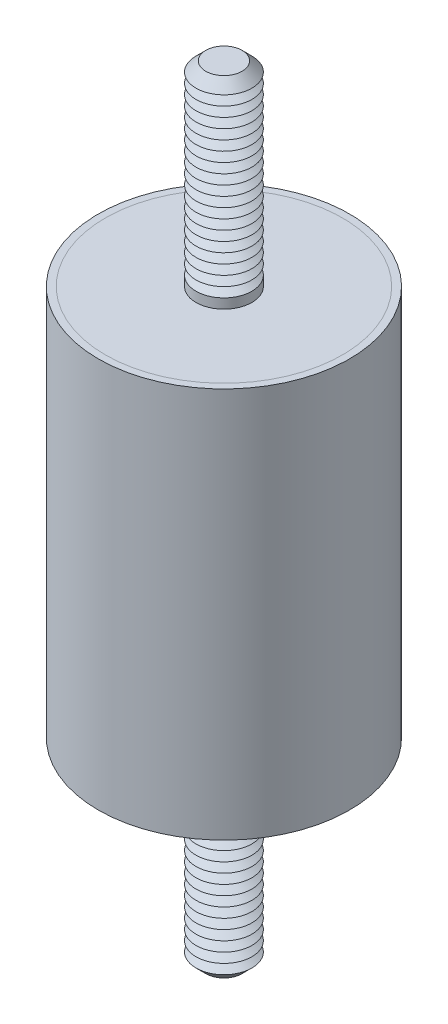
ISO-10303-21;
HEADER;
FILE_DESCRIPTION(('STEP AP214'),'2;1');
FILE_NAME('part.step','',(''),(''),'','','');
FILE_SCHEMA(('AUTOMOTIVE_DESIGN { 1 0 10303 214 1 1 1 1 }'));
ENDSEC;
DATA;
#1=APPLICATION_CONTEXT('core data for automotive mechanical design processes');
#2=APPLICATION_PROTOCOL_DEFINITION('international standard','automotive_design',2000,#1);
#3=PRODUCT_CONTEXT('',#1,'mechanical');
#4=PRODUCT('Part','Part','',(#3));
#5=PRODUCT_RELATED_PRODUCT_CATEGORY('part','',(#4));
#6=PRODUCT_DEFINITION_FORMATION('','',#4);
#7=PRODUCT_DEFINITION_CONTEXT('part definition',#1,'design');
#8=PRODUCT_DEFINITION('design','',#6,#7);
#9=PRODUCT_DEFINITION_SHAPE('','',#8);
#10=(LENGTH_UNIT() NAMED_UNIT(*) SI_UNIT(.MILLI.,.METRE.));
#11=(NAMED_UNIT(*) PLANE_ANGLE_UNIT() SI_UNIT($,.RADIAN.));
#12=(NAMED_UNIT(*) SI_UNIT($,.STERADIAN.) SOLID_ANGLE_UNIT());
#13=UNCERTAINTY_MEASURE_WITH_UNIT(LENGTH_MEASURE(1.E-05),#10,'distance_accuracy_value','');
#14=(GEOMETRIC_REPRESENTATION_CONTEXT(3) GLOBAL_UNCERTAINTY_ASSIGNED_CONTEXT((#13)) GLOBAL_UNIT_ASSIGNED_CONTEXT((#10,
#11,#12)) REPRESENTATION_CONTEXT('',''));
#15=CARTESIAN_POINT('',(0.,0.,0.));
#16=DIRECTION('',(0.,0.,1.));
#17=DIRECTION('',(1.,0.,0.));
#18=AXIS2_PLACEMENT_3D('',#15,#16,#17);
#19=CARTESIAN_POINT('',(0.,-28.,0.));
#20=DIRECTION('',(0.,1.,0.));
#21=DIRECTION('',(0.,0.,1.));
#22=AXIS2_PLACEMENT_3D('',#19,#20,#21);
#23=CYLINDRICAL_SURFACE('',#22,2.);
#24=CARTESIAN_POINT('',(0.,-14.,0.));
#25=DIRECTION('',(0.,-1.,0.));
#26=DIRECTION('',(0.,0.,-1.));
#27=AXIS2_PLACEMENT_3D('',#24,#25,#26);
#28=CIRCLE('',#27,2.);
#29=CARTESIAN_POINT('',(0.,-14.,-2.));
#30=VERTEX_POINT('',#29);
#31=EDGE_CURVE('P0_E21',#30,#30,#28,.T.);
#32=ORIENTED_EDGE('',*,*,#31,.T.);
#33=EDGE_LOOP('',(#32));
#34=FACE_BOUND('',#33,.T.);
#35=CARTESIAN_POINT('',(0.,-14.7,0.));
#36=DIRECTION('',(0.,1.,0.));
#37=DIRECTION('',(0.,0.,1.));
#38=AXIS2_PLACEMENT_3D('',#35,#36,#37);
#39=CIRCLE('',#38,2.);
#40=CARTESIAN_POINT('',(0.,-14.7,2.));
#41=VERTEX_POINT('',#40);
#42=EDGE_CURVE('P0_E33',#41,#41,#39,.T.);
#43=ORIENTED_EDGE('',*,*,#42,.T.);
#44=EDGE_LOOP('',(#43));
#45=FACE_BOUND('',#44,.T.);
#46=ADVANCED_FACE('P0_F14',(#34,#45),#23,.T.);
#47=CARTESIAN_POINT('',(0.,-14.,0.));
#48=DIRECTION('',(0.,1.,0.));
#49=DIRECTION('',(0.,0.,1.));
#50=AXIS2_PLACEMENT_3D('',#47,#48,#49);
#51=CYLINDRICAL_SURFACE('',#50,8.5);
#52=CARTESIAN_POINT('',(0.,-14.,0.));
#53=DIRECTION('',(0.,1.,0.));
#54=DIRECTION('',(0.,0.,1.));
#55=AXIS2_PLACEMENT_3D('',#52,#53,#54);
#56=CIRCLE('',#55,8.5);
#57=CARTESIAN_POINT('',(0.,-14.,8.5));
#58=VERTEX_POINT('',#57);
#59=EDGE_CURVE('P0_E25',#58,#58,#56,.T.);
#60=ORIENTED_EDGE('',*,*,#59,.T.);
#61=EDGE_LOOP('',(#60));
#62=FACE_BOUND('',#61,.T.);
#63=CARTESIAN_POINT('',(0.,-13.,0.));
#64=DIRECTION('',(0.,1.,0.));
#65=DIRECTION('',(0.,0.,1.));
#66=AXIS2_PLACEMENT_3D('',#63,#64,#65);
#67=CIRCLE('',#66,8.5);
#68=CARTESIAN_POINT('',(0.,-13.,8.5));
#69=VERTEX_POINT('',#68);
#70=EDGE_CURVE('P0_E30',#69,#69,#67,.T.);
#71=ORIENTED_EDGE('',*,*,#70,.F.);
#72=EDGE_LOOP('',(#71));
#73=FACE_BOUND('',#72,.T.);
#74=ADVANCED_FACE('P0_F169',(#62,#73),#51,.T.);
#75=CARTESIAN_POINT('',(0.,-14.,0.));
#76=DIRECTION('',(0.,1.,0.));
#77=DIRECTION('',(0.,0.,1.));
#78=AXIS2_PLACEMENT_3D('',#75,#76,#77);
#79=PLANE('',#78);
#80=ORIENTED_EDGE('',*,*,#31,.F.);
#81=EDGE_LOOP('',(#80));
#82=FACE_BOUND('',#81,.T.);
#83=ORIENTED_EDGE('',*,*,#59,.F.);
#84=EDGE_LOOP('',(#83));
#85=FACE_BOUND('',#84,.T.);
#86=ADVANCED_FACE('P0_F174',(#82,#85),#79,.F.);
#87=CARTESIAN_POINT('',(0.,-13.,0.));
#88=DIRECTION('',(0.,1.,0.));
#89=DIRECTION('',(0.,0.,1.));
#90=AXIS2_PLACEMENT_3D('',#87,#88,#89);
#91=PLANE('',#90);
#92=ORIENTED_EDGE('',*,*,#70,.T.);
#93=EDGE_LOOP('',(#92));
#94=FACE_BOUND('',#93,.T.);
#95=ADVANCED_FACE('P0_F180',(#94),#91,.T.);
#96=CARTESIAN_POINT('',(0.,-14.7,0.));
#97=DIRECTION('',(0.,1.,0.));
#98=DIRECTION('',(0.,0.,1.));
#99=AXIS2_PLACEMENT_3D('',#96,#97,#98);
#100=CONICAL_SURFACE('',#99,2.,1.0471975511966);
#101=CARTESIAN_POINT('',(0.,-15.05,0.));
#102=DIRECTION('',(0.,1.,0.));
#103=DIRECTION('',(0.,0.,1.));
#104=AXIS2_PLACEMENT_3D('',#101,#102,#103);
#105=CIRCLE('',#104,1.39378221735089);
#106=CARTESIAN_POINT('',(0.,-15.05,1.39378221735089));
#107=VERTEX_POINT('',#106);
#108=EDGE_CURVE('P0_E39',#107,#107,#105,.T.);
#109=ORIENTED_EDGE('',*,*,#108,.T.);
#110=EDGE_LOOP('',(#109));
#111=FACE_BOUND('',#110,.T.);
#112=ORIENTED_EDGE('',*,*,#42,.F.);
#113=EDGE_LOOP('',(#112));
#114=FACE_BOUND('',#113,.T.);
#115=ADVANCED_FACE('P0_F183',(#111,#114),#100,.T.);
#116=CARTESIAN_POINT('',(0.,-15.05,0.));
#117=DIRECTION('',(0.,-1.,0.));
#118=DIRECTION('',(0.,0.,-1.));
#119=AXIS2_PLACEMENT_3D('',#116,#117,#118);
#120=CONICAL_SURFACE('',#119,1.39378221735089,1.0471975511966);
#121=CARTESIAN_POINT('',(0.,-15.4,0.));
#122=DIRECTION('',(0.,1.,0.));
#123=DIRECTION('',(0.,0.,1.));
#124=AXIS2_PLACEMENT_3D('',#121,#122,#123);
#125=CIRCLE('',#124,2.);
#126=CARTESIAN_POINT('',(0.,-15.4,2.));
#127=VERTEX_POINT('',#126);
#128=EDGE_CURVE('P0_E43',#127,#127,#125,.T.);
#129=ORIENTED_EDGE('',*,*,#128,.T.);
#130=EDGE_LOOP('',(#129));
#131=FACE_BOUND('',#130,.T.);
#132=ORIENTED_EDGE('',*,*,#108,.F.);
#133=EDGE_LOOP('',(#132));
#134=FACE_BOUND('',#133,.T.);
#135=ADVANCED_FACE('P0_F187',(#131,#134),#120,.T.);
#136=CARTESIAN_POINT('',(0.,-15.4,0.));
#137=DIRECTION('',(0.,1.,0.));
#138=DIRECTION('',(0.,0.,1.));
#139=AXIS2_PLACEMENT_3D('',#136,#137,#138);
#140=CONICAL_SURFACE('',#139,2.,1.0471975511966);
#141=CARTESIAN_POINT('',(0.,-15.75,0.));
#142=DIRECTION('',(0.,1.,0.));
#143=DIRECTION('',(0.,0.,1.));
#144=AXIS2_PLACEMENT_3D('',#141,#142,#143);
#145=CIRCLE('',#144,1.39378221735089);
#146=CARTESIAN_POINT('',(0.,-15.75,1.39378221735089));
#147=VERTEX_POINT('',#146);
#148=EDGE_CURVE('P0_E47',#147,#147,#145,.T.);
#149=ORIENTED_EDGE('',*,*,#148,.T.);
#150=EDGE_LOOP('',(#149));
#151=FACE_BOUND('',#150,.T.);
#152=ORIENTED_EDGE('',*,*,#128,.F.);
#153=EDGE_LOOP('',(#152));
#154=FACE_BOUND('',#153,.T.);
#155=ADVANCED_FACE('P0_F191',(#151,#154),#140,.T.);
#156=CARTESIAN_POINT('',(0.,-15.75,0.));
#157=DIRECTION('',(0.,-1.,0.));
#158=DIRECTION('',(0.,0.,-1.));
#159=AXIS2_PLACEMENT_3D('',#156,#157,#158);
#160=CONICAL_SURFACE('',#159,1.39378221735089,1.0471975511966);
#161=CARTESIAN_POINT('',(0.,-16.1,0.));
#162=DIRECTION('',(0.,1.,0.));
#163=DIRECTION('',(0.,0.,1.));
#164=AXIS2_PLACEMENT_3D('',#161,#162,#163);
#165=CIRCLE('',#164,2.);
#166=CARTESIAN_POINT('',(0.,-16.1,2.));
#167=VERTEX_POINT('',#166);
#168=EDGE_CURVE('P0_E52',#167,#167,#165,.T.);
#169=ORIENTED_EDGE('',*,*,#168,.T.);
#170=EDGE_LOOP('',(#169));
#171=FACE_BOUND('',#170,.T.);
#172=ORIENTED_EDGE('',*,*,#148,.F.);
#173=EDGE_LOOP('',(#172));
#174=FACE_BOUND('',#173,.T.);
#175=ADVANCED_FACE('P0_F198',(#171,#174),#160,.T.);
#176=CARTESIAN_POINT('',(0.,-16.1,0.));
#177=DIRECTION('',(0.,1.,0.));
#178=DIRECTION('',(0.,0.,1.));
#179=AXIS2_PLACEMENT_3D('',#176,#177,#178);
#180=CONICAL_SURFACE('',#179,2.,1.0471975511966);
#181=CARTESIAN_POINT('',(0.,-16.45,0.));
#182=DIRECTION('',(0.,1.,0.));
#183=DIRECTION('',(0.,0.,1.));
#184=AXIS2_PLACEMENT_3D('',#181,#182,#183);
#185=CIRCLE('',#184,1.39378221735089);
#186=CARTESIAN_POINT('',(0.,-16.45,1.39378221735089));
#187=VERTEX_POINT('',#186);
#188=EDGE_CURVE('P0_E55',#187,#187,#185,.T.);
#189=ORIENTED_EDGE('',*,*,#188,.T.);
#190=EDGE_LOOP('',(#189));
#191=FACE_BOUND('',#190,.T.);
#192=ORIENTED_EDGE('',*,*,#168,.F.);
#193=EDGE_LOOP('',(#192));
#194=FACE_BOUND('',#193,.T.);
#195=ADVANCED_FACE('P0_F202',(#191,#194),#180,.T.);
#196=CARTESIAN_POINT('',(0.,-16.45,0.));
#197=DIRECTION('',(0.,-1.,0.));
#198=DIRECTION('',(0.,0.,-1.));
#199=AXIS2_PLACEMENT_3D('',#196,#197,#198);
#200=CONICAL_SURFACE('',#199,1.39378221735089,1.0471975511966);
#201=CARTESIAN_POINT('',(0.,-16.8,0.));
#202=DIRECTION('',(0.,1.,0.));
#203=DIRECTION('',(0.,0.,1.));
#204=AXIS2_PLACEMENT_3D('',#201,#202,#203);
#205=CIRCLE('',#204,2.);
#206=CARTESIAN_POINT('',(0.,-16.8,2.));
#207=VERTEX_POINT('',#206);
#208=EDGE_CURVE('P0_E58',#207,#207,#205,.T.);
#209=ORIENTED_EDGE('',*,*,#208,.T.);
#210=EDGE_LOOP('',(#209));
#211=FACE_BOUND('',#210,.T.);
#212=ORIENTED_EDGE('',*,*,#188,.F.);
#213=EDGE_LOOP('',(#212));
#214=FACE_BOUND('',#213,.T.);
#215=ADVANCED_FACE('P0_F206',(#211,#214),#200,.T.);
#216=CARTESIAN_POINT('',(0.,-16.8,0.));
#217=DIRECTION('',(0.,1.,0.));
#218=DIRECTION('',(0.,0.,1.));
#219=AXIS2_PLACEMENT_3D('',#216,#217,#218);
#220=CONICAL_SURFACE('',#219,2.,1.0471975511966);
#221=CARTESIAN_POINT('',(0.,-17.15,0.));
#222=DIRECTION('',(0.,1.,0.));
#223=DIRECTION('',(0.,0.,1.));
#224=AXIS2_PLACEMENT_3D('',#221,#222,#223);
#225=CIRCLE('',#224,1.39378221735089);
#226=CARTESIAN_POINT('',(0.,-17.15,1.39378221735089));
#227=VERTEX_POINT('',#226);
#228=EDGE_CURVE('P0_E61',#227,#227,#225,.T.);
#229=ORIENTED_EDGE('',*,*,#228,.T.);
#230=EDGE_LOOP('',(#229));
#231=FACE_BOUND('',#230,.T.);
#232=ORIENTED_EDGE('',*,*,#208,.F.);
#233=EDGE_LOOP('',(#232));
#234=FACE_BOUND('',#233,.T.);
#235=ADVANCED_FACE('P0_F210',(#231,#234),#220,.T.);
#236=CARTESIAN_POINT('',(0.,-17.15,0.));
#237=DIRECTION('',(0.,-1.,0.));
#238=DIRECTION('',(0.,0.,-1.));
#239=AXIS2_PLACEMENT_3D('',#236,#237,#238);
#240=CONICAL_SURFACE('',#239,1.39378221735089,1.0471975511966);
#241=CARTESIAN_POINT('',(0.,-17.5,0.));
#242=DIRECTION('',(0.,1.,0.));
#243=DIRECTION('',(0.,0.,1.));
#244=AXIS2_PLACEMENT_3D('',#241,#242,#243);
#245=CIRCLE('',#244,2.);
#246=CARTESIAN_POINT('',(0.,-17.5,2.));
#247=VERTEX_POINT('',#246);
#248=EDGE_CURVE('P0_E64',#247,#247,#245,.T.);
#249=ORIENTED_EDGE('',*,*,#248,.T.);
#250=EDGE_LOOP('',(#249));
#251=FACE_BOUND('',#250,.T.);
#252=ORIENTED_EDGE('',*,*,#228,.F.);
#253=EDGE_LOOP('',(#252));
#254=FACE_BOUND('',#253,.T.);
#255=ADVANCED_FACE('P0_F214',(#251,#254),#240,.T.);
#256=CARTESIAN_POINT('',(0.,-17.5,0.));
#257=DIRECTION('',(0.,1.,0.));
#258=DIRECTION('',(0.,0.,1.));
#259=AXIS2_PLACEMENT_3D('',#256,#257,#258);
#260=CONICAL_SURFACE('',#259,2.,1.0471975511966);
#261=CARTESIAN_POINT('',(0.,-17.85,0.));
#262=DIRECTION('',(0.,1.,0.));
#263=DIRECTION('',(0.,0.,1.));
#264=AXIS2_PLACEMENT_3D('',#261,#262,#263);
#265=CIRCLE('',#264,1.39378221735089);
#266=CARTESIAN_POINT('',(0.,-17.85,1.39378221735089));
#267=VERTEX_POINT('',#266);
#268=EDGE_CURVE('P0_E67',#267,#267,#265,.T.);
#269=ORIENTED_EDGE('',*,*,#268,.T.);
#270=EDGE_LOOP('',(#269));
#271=FACE_BOUND('',#270,.T.);
#272=ORIENTED_EDGE('',*,*,#248,.F.);
#273=EDGE_LOOP('',(#272));
#274=FACE_BOUND('',#273,.T.);
#275=ADVANCED_FACE('P0_F218',(#271,#274),#260,.T.);
#276=CARTESIAN_POINT('',(0.,-17.85,0.));
#277=DIRECTION('',(0.,-1.,0.));
#278=DIRECTION('',(0.,0.,-1.));
#279=AXIS2_PLACEMENT_3D('',#276,#277,#278);
#280=CONICAL_SURFACE('',#279,1.39378221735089,1.0471975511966);
#281=CARTESIAN_POINT('',(0.,-18.2,0.));
#282=DIRECTION('',(0.,1.,0.));
#283=DIRECTION('',(0.,0.,1.));
#284=AXIS2_PLACEMENT_3D('',#281,#282,#283);
#285=CIRCLE('',#284,2.);
#286=CARTESIAN_POINT('',(0.,-18.2,2.));
#287=VERTEX_POINT('',#286);
#288=EDGE_CURVE('P0_E70',#287,#287,#285,.T.);
#289=ORIENTED_EDGE('',*,*,#288,.T.);
#290=EDGE_LOOP('',(#289));
#291=FACE_BOUND('',#290,.T.);
#292=ORIENTED_EDGE('',*,*,#268,.F.);
#293=EDGE_LOOP('',(#292));
#294=FACE_BOUND('',#293,.T.);
#295=ADVANCED_FACE('P0_F222',(#291,#294),#280,.T.);
#296=CARTESIAN_POINT('',(0.,-18.2,0.));
#297=DIRECTION('',(0.,1.,0.));
#298=DIRECTION('',(0.,0.,1.));
#299=AXIS2_PLACEMENT_3D('',#296,#297,#298);
#300=CONICAL_SURFACE('',#299,2.,1.0471975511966);
#301=CARTESIAN_POINT('',(0.,-18.55,0.));
#302=DIRECTION('',(0.,1.,0.));
#303=DIRECTION('',(0.,0.,1.));
#304=AXIS2_PLACEMENT_3D('',#301,#302,#303);
#305=CIRCLE('',#304,1.39378221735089);
#306=CARTESIAN_POINT('',(0.,-18.55,1.39378221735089));
#307=VERTEX_POINT('',#306);
#308=EDGE_CURVE('P0_E73',#307,#307,#305,.T.);
#309=ORIENTED_EDGE('',*,*,#308,.T.);
#310=EDGE_LOOP('',(#309));
#311=FACE_BOUND('',#310,.T.);
#312=ORIENTED_EDGE('',*,*,#288,.F.);
#313=EDGE_LOOP('',(#312));
#314=FACE_BOUND('',#313,.T.);
#315=ADVANCED_FACE('P0_F226',(#311,#314),#300,.T.);
#316=CARTESIAN_POINT('',(0.,-18.55,0.));
#317=DIRECTION('',(0.,-1.,0.));
#318=DIRECTION('',(0.,0.,-1.));
#319=AXIS2_PLACEMENT_3D('',#316,#317,#318);
#320=CONICAL_SURFACE('',#319,1.39378221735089,1.0471975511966);
#321=CARTESIAN_POINT('',(0.,-18.9,0.));
#322=DIRECTION('',(0.,1.,0.));
#323=DIRECTION('',(0.,0.,1.));
#324=AXIS2_PLACEMENT_3D('',#321,#322,#323);
#325=CIRCLE('',#324,2.);
#326=CARTESIAN_POINT('',(0.,-18.9,2.));
#327=VERTEX_POINT('',#326);
#328=EDGE_CURVE('P0_E76',#327,#327,#325,.T.);
#329=ORIENTED_EDGE('',*,*,#328,.T.);
#330=EDGE_LOOP('',(#329));
#331=FACE_BOUND('',#330,.T.);
#332=ORIENTED_EDGE('',*,*,#308,.F.);
#333=EDGE_LOOP('',(#332));
#334=FACE_BOUND('',#333,.T.);
#335=ADVANCED_FACE('P0_F230',(#331,#334),#320,.T.);
#336=CARTESIAN_POINT('',(0.,-18.9,0.));
#337=DIRECTION('',(0.,1.,0.));
#338=DIRECTION('',(0.,0.,1.));
#339=AXIS2_PLACEMENT_3D('',#336,#337,#338);
#340=CONICAL_SURFACE('',#339,2.,1.0471975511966);
#341=CARTESIAN_POINT('',(0.,-19.25,0.));
#342=DIRECTION('',(0.,1.,0.));
#343=DIRECTION('',(0.,0.,1.));
#344=AXIS2_PLACEMENT_3D('',#341,#342,#343);
#345=CIRCLE('',#344,1.39378221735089);
#346=CARTESIAN_POINT('',(0.,-19.25,1.39378221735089));
#347=VERTEX_POINT('',#346);
#348=EDGE_CURVE('P0_E79',#347,#347,#345,.T.);
#349=ORIENTED_EDGE('',*,*,#348,.T.);
#350=EDGE_LOOP('',(#349));
#351=FACE_BOUND('',#350,.T.);
#352=ORIENTED_EDGE('',*,*,#328,.F.);
#353=EDGE_LOOP('',(#352));
#354=FACE_BOUND('',#353,.T.);
#355=ADVANCED_FACE('P0_F234',(#351,#354),#340,.T.);
#356=CARTESIAN_POINT('',(0.,-19.25,0.));
#357=DIRECTION('',(0.,-1.,0.));
#358=DIRECTION('',(0.,0.,-1.));
#359=AXIS2_PLACEMENT_3D('',#356,#357,#358);
#360=CONICAL_SURFACE('',#359,1.39378221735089,1.0471975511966);
#361=CARTESIAN_POINT('',(0.,-19.6,0.));
#362=DIRECTION('',(0.,1.,0.));
#363=DIRECTION('',(0.,0.,1.));
#364=AXIS2_PLACEMENT_3D('',#361,#362,#363);
#365=CIRCLE('',#364,2.);
#366=CARTESIAN_POINT('',(0.,-19.6,2.));
#367=VERTEX_POINT('',#366);
#368=EDGE_CURVE('P0_E82',#367,#367,#365,.T.);
#369=ORIENTED_EDGE('',*,*,#368,.T.);
#370=EDGE_LOOP('',(#369));
#371=FACE_BOUND('',#370,.T.);
#372=ORIENTED_EDGE('',*,*,#348,.F.);
#373=EDGE_LOOP('',(#372));
#374=FACE_BOUND('',#373,.T.);
#375=ADVANCED_FACE('P0_F238',(#371,#374),#360,.T.);
#376=CARTESIAN_POINT('',(0.,-19.6,0.));
#377=DIRECTION('',(0.,1.,0.));
#378=DIRECTION('',(0.,0.,1.));
#379=AXIS2_PLACEMENT_3D('',#376,#377,#378);
#380=CONICAL_SURFACE('',#379,2.,1.0471975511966);
#381=CARTESIAN_POINT('',(0.,-19.95,0.));
#382=DIRECTION('',(0.,1.,0.));
#383=DIRECTION('',(0.,0.,1.));
#384=AXIS2_PLACEMENT_3D('',#381,#382,#383);
#385=CIRCLE('',#384,1.39378221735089);
#386=CARTESIAN_POINT('',(0.,-19.95,1.39378221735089));
#387=VERTEX_POINT('',#386);
#388=EDGE_CURVE('P0_E85',#387,#387,#385,.T.);
#389=ORIENTED_EDGE('',*,*,#388,.T.);
#390=EDGE_LOOP('',(#389));
#391=FACE_BOUND('',#390,.T.);
#392=ORIENTED_EDGE('',*,*,#368,.F.);
#393=EDGE_LOOP('',(#392));
#394=FACE_BOUND('',#393,.T.);
#395=ADVANCED_FACE('P0_F242',(#391,#394),#380,.T.);
#396=CARTESIAN_POINT('',(0.,-19.95,0.));
#397=DIRECTION('',(0.,-1.,0.));
#398=DIRECTION('',(0.,0.,-1.));
#399=AXIS2_PLACEMENT_3D('',#396,#397,#398);
#400=CONICAL_SURFACE('',#399,1.39378221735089,1.0471975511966);
#401=CARTESIAN_POINT('',(0.,-20.3,0.));
#402=DIRECTION('',(0.,1.,0.));
#403=DIRECTION('',(0.,0.,1.));
#404=AXIS2_PLACEMENT_3D('',#401,#402,#403);
#405=CIRCLE('',#404,2.);
#406=CARTESIAN_POINT('',(0.,-20.3,2.));
#407=VERTEX_POINT('',#406);
#408=EDGE_CURVE('P0_E88',#407,#407,#405,.T.);
#409=ORIENTED_EDGE('',*,*,#408,.T.);
#410=EDGE_LOOP('',(#409));
#411=FACE_BOUND('',#410,.T.);
#412=ORIENTED_EDGE('',*,*,#388,.F.);
#413=EDGE_LOOP('',(#412));
#414=FACE_BOUND('',#413,.T.);
#415=ADVANCED_FACE('P0_F246',(#411,#414),#400,.T.);
#416=CARTESIAN_POINT('',(0.,-20.3,0.));
#417=DIRECTION('',(0.,1.,0.));
#418=DIRECTION('',(0.,0.,1.));
#419=AXIS2_PLACEMENT_3D('',#416,#417,#418);
#420=CONICAL_SURFACE('',#419,2.,1.0471975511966);
#421=CARTESIAN_POINT('',(0.,-20.65,0.));
#422=DIRECTION('',(0.,1.,0.));
#423=DIRECTION('',(0.,0.,1.));
#424=AXIS2_PLACEMENT_3D('',#421,#422,#423);
#425=CIRCLE('',#424,1.39378221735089);
#426=CARTESIAN_POINT('',(0.,-20.65,1.39378221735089));
#427=VERTEX_POINT('',#426);
#428=EDGE_CURVE('P0_E91',#427,#427,#425,.T.);
#429=ORIENTED_EDGE('',*,*,#428,.T.);
#430=EDGE_LOOP('',(#429));
#431=FACE_BOUND('',#430,.T.);
#432=ORIENTED_EDGE('',*,*,#408,.F.);
#433=EDGE_LOOP('',(#432));
#434=FACE_BOUND('',#433,.T.);
#435=ADVANCED_FACE('P0_F250',(#431,#434),#420,.T.);
#436=CARTESIAN_POINT('',(0.,-20.65,0.));
#437=DIRECTION('',(0.,-1.,0.));
#438=DIRECTION('',(0.,0.,-1.));
#439=AXIS2_PLACEMENT_3D('',#436,#437,#438);
#440=CONICAL_SURFACE('',#439,1.39378221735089,1.0471975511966);
#441=CARTESIAN_POINT('',(0.,-21.,0.));
#442=DIRECTION('',(0.,1.,0.));
#443=DIRECTION('',(0.,0.,1.));
#444=AXIS2_PLACEMENT_3D('',#441,#442,#443);
#445=CIRCLE('',#444,2.);
#446=CARTESIAN_POINT('',(0.,-21.,2.));
#447=VERTEX_POINT('',#446);
#448=EDGE_CURVE('P0_E94',#447,#447,#445,.T.);
#449=ORIENTED_EDGE('',*,*,#448,.T.);
#450=EDGE_LOOP('',(#449));
#451=FACE_BOUND('',#450,.T.);
#452=ORIENTED_EDGE('',*,*,#428,.F.);
#453=EDGE_LOOP('',(#452));
#454=FACE_BOUND('',#453,.T.);
#455=ADVANCED_FACE('P0_F254',(#451,#454),#440,.T.);
#456=CARTESIAN_POINT('',(0.,-21.,0.));
#457=DIRECTION('',(0.,1.,0.));
#458=DIRECTION('',(0.,0.,1.));
#459=AXIS2_PLACEMENT_3D('',#456,#457,#458);
#460=CONICAL_SURFACE('',#459,2.,1.0471975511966);
#461=CARTESIAN_POINT('',(0.,-21.35,0.));
#462=DIRECTION('',(0.,1.,0.));
#463=DIRECTION('',(0.,0.,1.));
#464=AXIS2_PLACEMENT_3D('',#461,#462,#463);
#465=CIRCLE('',#464,1.39378221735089);
#466=CARTESIAN_POINT('',(0.,-21.35,1.39378221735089));
#467=VERTEX_POINT('',#466);
#468=EDGE_CURVE('P0_E97',#467,#467,#465,.T.);
#469=ORIENTED_EDGE('',*,*,#468,.T.);
#470=EDGE_LOOP('',(#469));
#471=FACE_BOUND('',#470,.T.);
#472=ORIENTED_EDGE('',*,*,#448,.F.);
#473=EDGE_LOOP('',(#472));
#474=FACE_BOUND('',#473,.T.);
#475=ADVANCED_FACE('P0_F258',(#471,#474),#460,.T.);
#476=CARTESIAN_POINT('',(0.,-21.35,0.));
#477=DIRECTION('',(0.,-1.,0.));
#478=DIRECTION('',(0.,0.,-1.));
#479=AXIS2_PLACEMENT_3D('',#476,#477,#478);
#480=CONICAL_SURFACE('',#479,1.39378221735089,1.0471975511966);
#481=CARTESIAN_POINT('',(0.,-21.7,0.));
#482=DIRECTION('',(0.,1.,0.));
#483=DIRECTION('',(0.,0.,1.));
#484=AXIS2_PLACEMENT_3D('',#481,#482,#483);
#485=CIRCLE('',#484,2.);
#486=CARTESIAN_POINT('',(0.,-21.7,2.));
#487=VERTEX_POINT('',#486);
#488=EDGE_CURVE('P0_E100',#487,#487,#485,.T.);
#489=ORIENTED_EDGE('',*,*,#488,.T.);
#490=EDGE_LOOP('',(#489));
#491=FACE_BOUND('',#490,.T.);
#492=ORIENTED_EDGE('',*,*,#468,.F.);
#493=EDGE_LOOP('',(#492));
#494=FACE_BOUND('',#493,.T.);
#495=ADVANCED_FACE('P0_F262',(#491,#494),#480,.T.);
#496=CARTESIAN_POINT('',(0.,-21.7,0.));
#497=DIRECTION('',(0.,1.,0.));
#498=DIRECTION('',(0.,0.,1.));
#499=AXIS2_PLACEMENT_3D('',#496,#497,#498);
#500=CONICAL_SURFACE('',#499,2.,1.0471975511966);
#501=CARTESIAN_POINT('',(0.,-22.05,0.));
#502=DIRECTION('',(0.,1.,0.));
#503=DIRECTION('',(0.,0.,1.));
#504=AXIS2_PLACEMENT_3D('',#501,#502,#503);
#505=CIRCLE('',#504,1.39378221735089);
#506=CARTESIAN_POINT('',(0.,-22.05,1.39378221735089));
#507=VERTEX_POINT('',#506);
#508=EDGE_CURVE('P0_E103',#507,#507,#505,.T.);
#509=ORIENTED_EDGE('',*,*,#508,.T.);
#510=EDGE_LOOP('',(#509));
#511=FACE_BOUND('',#510,.T.);
#512=ORIENTED_EDGE('',*,*,#488,.F.);
#513=EDGE_LOOP('',(#512));
#514=FACE_BOUND('',#513,.T.);
#515=ADVANCED_FACE('P0_F266',(#511,#514),#500,.T.);
#516=CARTESIAN_POINT('',(0.,-22.05,0.));
#517=DIRECTION('',(0.,-1.,0.));
#518=DIRECTION('',(0.,0.,-1.));
#519=AXIS2_PLACEMENT_3D('',#516,#517,#518);
#520=CONICAL_SURFACE('',#519,1.39378221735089,1.0471975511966);
#521=CARTESIAN_POINT('',(0.,-22.4,0.));
#522=DIRECTION('',(0.,1.,0.));
#523=DIRECTION('',(0.,0.,1.));
#524=AXIS2_PLACEMENT_3D('',#521,#522,#523);
#525=CIRCLE('',#524,2.);
#526=CARTESIAN_POINT('',(0.,-22.4,2.));
#527=VERTEX_POINT('',#526);
#528=EDGE_CURVE('P0_E106',#527,#527,#525,.T.);
#529=ORIENTED_EDGE('',*,*,#528,.T.);
#530=EDGE_LOOP('',(#529));
#531=FACE_BOUND('',#530,.T.);
#532=ORIENTED_EDGE('',*,*,#508,.F.);
#533=EDGE_LOOP('',(#532));
#534=FACE_BOUND('',#533,.T.);
#535=ADVANCED_FACE('P0_F270',(#531,#534),#520,.T.);
#536=CARTESIAN_POINT('',(0.,-22.4,0.));
#537=DIRECTION('',(0.,1.,0.));
#538=DIRECTION('',(0.,0.,1.));
#539=AXIS2_PLACEMENT_3D('',#536,#537,#538);
#540=CONICAL_SURFACE('',#539,2.,1.0471975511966);
#541=CARTESIAN_POINT('',(0.,-22.75,0.));
#542=DIRECTION('',(0.,1.,0.));
#543=DIRECTION('',(0.,0.,1.));
#544=AXIS2_PLACEMENT_3D('',#541,#542,#543);
#545=CIRCLE('',#544,1.39378221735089);
#546=CARTESIAN_POINT('',(0.,-22.75,1.39378221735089));
#547=VERTEX_POINT('',#546);
#548=EDGE_CURVE('P0_E109',#547,#547,#545,.T.);
#549=ORIENTED_EDGE('',*,*,#548,.T.);
#550=EDGE_LOOP('',(#549));
#551=FACE_BOUND('',#550,.T.);
#552=ORIENTED_EDGE('',*,*,#528,.F.);
#553=EDGE_LOOP('',(#552));
#554=FACE_BOUND('',#553,.T.);
#555=ADVANCED_FACE('P0_F274',(#551,#554),#540,.T.);
#556=CARTESIAN_POINT('',(0.,-22.75,0.));
#557=DIRECTION('',(0.,-1.,0.));
#558=DIRECTION('',(0.,0.,-1.));
#559=AXIS2_PLACEMENT_3D('',#556,#557,#558);
#560=CONICAL_SURFACE('',#559,1.39378221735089,1.0471975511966);
#561=CARTESIAN_POINT('',(0.,-23.1,0.));
#562=DIRECTION('',(0.,1.,0.));
#563=DIRECTION('',(0.,0.,1.));
#564=AXIS2_PLACEMENT_3D('',#561,#562,#563);
#565=CIRCLE('',#564,2.);
#566=CARTESIAN_POINT('',(0.,-23.1,2.));
#567=VERTEX_POINT('',#566);
#568=EDGE_CURVE('P0_E112',#567,#567,#565,.T.);
#569=ORIENTED_EDGE('',*,*,#568,.T.);
#570=EDGE_LOOP('',(#569));
#571=FACE_BOUND('',#570,.T.);
#572=ORIENTED_EDGE('',*,*,#548,.F.);
#573=EDGE_LOOP('',(#572));
#574=FACE_BOUND('',#573,.T.);
#575=ADVANCED_FACE('P0_F278',(#571,#574),#560,.T.);
#576=CARTESIAN_POINT('',(0.,-23.1,0.));
#577=DIRECTION('',(0.,1.,0.));
#578=DIRECTION('',(0.,0.,1.));
#579=AXIS2_PLACEMENT_3D('',#576,#577,#578);
#580=CONICAL_SURFACE('',#579,2.,1.0471975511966);
#581=CARTESIAN_POINT('',(0.,-23.45,0.));
#582=DIRECTION('',(0.,1.,0.));
#583=DIRECTION('',(0.,0.,1.));
#584=AXIS2_PLACEMENT_3D('',#581,#582,#583);
#585=CIRCLE('',#584,1.39378221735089);
#586=CARTESIAN_POINT('',(0.,-23.45,1.39378221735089));
#587=VERTEX_POINT('',#586);
#588=EDGE_CURVE('P0_E115',#587,#587,#585,.T.);
#589=ORIENTED_EDGE('',*,*,#588,.T.);
#590=EDGE_LOOP('',(#589));
#591=FACE_BOUND('',#590,.T.);
#592=ORIENTED_EDGE('',*,*,#568,.F.);
#593=EDGE_LOOP('',(#592));
#594=FACE_BOUND('',#593,.T.);
#595=ADVANCED_FACE('P0_F282',(#591,#594),#580,.T.);
#596=CARTESIAN_POINT('',(0.,-23.45,0.));
#597=DIRECTION('',(0.,-1.,0.));
#598=DIRECTION('',(0.,0.,-1.));
#599=AXIS2_PLACEMENT_3D('',#596,#597,#598);
#600=CONICAL_SURFACE('',#599,1.39378221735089,1.0471975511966);
#601=CARTESIAN_POINT('',(0.,-23.8,0.));
#602=DIRECTION('',(0.,1.,0.));
#603=DIRECTION('',(0.,0.,1.));
#604=AXIS2_PLACEMENT_3D('',#601,#602,#603);
#605=CIRCLE('',#604,2.);
#606=CARTESIAN_POINT('',(0.,-23.8,2.));
#607=VERTEX_POINT('',#606);
#608=EDGE_CURVE('P0_E118',#607,#607,#605,.T.);
#609=ORIENTED_EDGE('',*,*,#608,.T.);
#610=EDGE_LOOP('',(#609));
#611=FACE_BOUND('',#610,.T.);
#612=ORIENTED_EDGE('',*,*,#588,.F.);
#613=EDGE_LOOP('',(#612));
#614=FACE_BOUND('',#613,.T.);
#615=ADVANCED_FACE('P0_F286',(#611,#614),#600,.T.);
#616=CARTESIAN_POINT('',(0.,-23.8,0.));
#617=DIRECTION('',(0.,1.,0.));
#618=DIRECTION('',(0.,0.,1.));
#619=AXIS2_PLACEMENT_3D('',#616,#617,#618);
#620=CONICAL_SURFACE('',#619,2.,1.0471975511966);
#621=CARTESIAN_POINT('',(0.,-24.15,0.));
#622=DIRECTION('',(0.,1.,0.));
#623=DIRECTION('',(0.,0.,1.));
#624=AXIS2_PLACEMENT_3D('',#621,#622,#623);
#625=CIRCLE('',#624,1.39378221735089);
#626=CARTESIAN_POINT('',(0.,-24.15,1.39378221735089));
#627=VERTEX_POINT('',#626);
#628=EDGE_CURVE('P0_E121',#627,#627,#625,.T.);
#629=ORIENTED_EDGE('',*,*,#628,.T.);
#630=EDGE_LOOP('',(#629));
#631=FACE_BOUND('',#630,.T.);
#632=ORIENTED_EDGE('',*,*,#608,.F.);
#633=EDGE_LOOP('',(#632));
#634=FACE_BOUND('',#633,.T.);
#635=ADVANCED_FACE('P0_F290',(#631,#634),#620,.T.);
#636=CARTESIAN_POINT('',(0.,-24.15,0.));
#637=DIRECTION('',(0.,-1.,0.));
#638=DIRECTION('',(0.,0.,-1.));
#639=AXIS2_PLACEMENT_3D('',#636,#637,#638);
#640=CONICAL_SURFACE('',#639,1.39378221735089,1.0471975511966);
#641=CARTESIAN_POINT('',(0.,-24.5,0.));
#642=DIRECTION('',(0.,1.,0.));
#643=DIRECTION('',(0.,0.,1.));
#644=AXIS2_PLACEMENT_3D('',#641,#642,#643);
#645=CIRCLE('',#644,2.);
#646=CARTESIAN_POINT('',(0.,-24.5,2.));
#647=VERTEX_POINT('',#646);
#648=EDGE_CURVE('P0_E124',#647,#647,#645,.T.);
#649=ORIENTED_EDGE('',*,*,#648,.T.);
#650=EDGE_LOOP('',(#649));
#651=FACE_BOUND('',#650,.T.);
#652=ORIENTED_EDGE('',*,*,#628,.F.);
#653=EDGE_LOOP('',(#652));
#654=FACE_BOUND('',#653,.T.);
#655=ADVANCED_FACE('P0_F294',(#651,#654),#640,.T.);
#656=CARTESIAN_POINT('',(0.,-24.5,0.));
#657=DIRECTION('',(0.,1.,0.));
#658=DIRECTION('',(0.,0.,1.));
#659=AXIS2_PLACEMENT_3D('',#656,#657,#658);
#660=CONICAL_SURFACE('',#659,2.,1.0471975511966);
#661=CARTESIAN_POINT('',(0.,-24.85,0.));
#662=DIRECTION('',(0.,1.,0.));
#663=DIRECTION('',(0.,0.,1.));
#664=AXIS2_PLACEMENT_3D('',#661,#662,#663);
#665=CIRCLE('',#664,1.39378221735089);
#666=CARTESIAN_POINT('',(0.,-24.85,1.39378221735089));
#667=VERTEX_POINT('',#666);
#668=EDGE_CURVE('P0_E127',#667,#667,#665,.T.);
#669=ORIENTED_EDGE('',*,*,#668,.T.);
#670=EDGE_LOOP('',(#669));
#671=FACE_BOUND('',#670,.T.);
#672=ORIENTED_EDGE('',*,*,#648,.F.);
#673=EDGE_LOOP('',(#672));
#674=FACE_BOUND('',#673,.T.);
#675=ADVANCED_FACE('P0_F298',(#671,#674),#660,.T.);
#676=CARTESIAN_POINT('',(0.,-24.85,0.));
#677=DIRECTION('',(0.,-1.,0.));
#678=DIRECTION('',(0.,0.,-1.));
#679=AXIS2_PLACEMENT_3D('',#676,#677,#678);
#680=CONICAL_SURFACE('',#679,1.39378221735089,1.0471975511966);
#681=CARTESIAN_POINT('',(0.,-25.2,0.));
#682=DIRECTION('',(0.,1.,0.));
#683=DIRECTION('',(0.,0.,1.));
#684=AXIS2_PLACEMENT_3D('',#681,#682,#683);
#685=CIRCLE('',#684,2.);
#686=CARTESIAN_POINT('',(0.,-25.2,2.));
#687=VERTEX_POINT('',#686);
#688=EDGE_CURVE('P0_E130',#687,#687,#685,.T.);
#689=ORIENTED_EDGE('',*,*,#688,.T.);
#690=EDGE_LOOP('',(#689));
#691=FACE_BOUND('',#690,.T.);
#692=ORIENTED_EDGE('',*,*,#668,.F.);
#693=EDGE_LOOP('',(#692));
#694=FACE_BOUND('',#693,.T.);
#695=ADVANCED_FACE('P0_F302',(#691,#694),#680,.T.);
#696=CARTESIAN_POINT('',(0.,-25.2,0.));
#697=DIRECTION('',(0.,1.,0.));
#698=DIRECTION('',(0.,0.,1.));
#699=AXIS2_PLACEMENT_3D('',#696,#697,#698);
#700=CONICAL_SURFACE('',#699,2.,1.0471975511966);
#701=CARTESIAN_POINT('',(0.,-25.55,0.));
#702=DIRECTION('',(0.,1.,0.));
#703=DIRECTION('',(0.,0.,1.));
#704=AXIS2_PLACEMENT_3D('',#701,#702,#703);
#705=CIRCLE('',#704,1.39378221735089);
#706=CARTESIAN_POINT('',(0.,-25.55,1.39378221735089));
#707=VERTEX_POINT('',#706);
#708=EDGE_CURVE('P0_E133',#707,#707,#705,.T.);
#709=ORIENTED_EDGE('',*,*,#708,.T.);
#710=EDGE_LOOP('',(#709));
#711=FACE_BOUND('',#710,.T.);
#712=ORIENTED_EDGE('',*,*,#688,.F.);
#713=EDGE_LOOP('',(#712));
#714=FACE_BOUND('',#713,.T.);
#715=ADVANCED_FACE('P0_F306',(#711,#714),#700,.T.);
#716=CARTESIAN_POINT('',(0.,-25.55,0.));
#717=DIRECTION('',(0.,-1.,0.));
#718=DIRECTION('',(0.,0.,-1.));
#719=AXIS2_PLACEMENT_3D('',#716,#717,#718);
#720=CONICAL_SURFACE('',#719,1.39378221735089,1.0471975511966);
#721=CARTESIAN_POINT('',(0.,-25.9,0.));
#722=DIRECTION('',(0.,1.,0.));
#723=DIRECTION('',(0.,0.,1.));
#724=AXIS2_PLACEMENT_3D('',#721,#722,#723);
#725=CIRCLE('',#724,2.);
#726=CARTESIAN_POINT('',(0.,-25.9,2.));
#727=VERTEX_POINT('',#726);
#728=EDGE_CURVE('P0_E136',#727,#727,#725,.T.);
#729=ORIENTED_EDGE('',*,*,#728,.T.);
#730=EDGE_LOOP('',(#729));
#731=FACE_BOUND('',#730,.T.);
#732=ORIENTED_EDGE('',*,*,#708,.F.);
#733=EDGE_LOOP('',(#732));
#734=FACE_BOUND('',#733,.T.);
#735=ADVANCED_FACE('P0_F310',(#731,#734),#720,.T.);
#736=CARTESIAN_POINT('',(0.,-25.9,0.));
#737=DIRECTION('',(0.,1.,0.));
#738=DIRECTION('',(0.,0.,1.));
#739=AXIS2_PLACEMENT_3D('',#736,#737,#738);
#740=CONICAL_SURFACE('',#739,2.,1.0471975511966);
#741=CARTESIAN_POINT('',(0.,-26.25,0.));
#742=DIRECTION('',(0.,1.,0.));
#743=DIRECTION('',(0.,0.,1.));
#744=AXIS2_PLACEMENT_3D('',#741,#742,#743);
#745=CIRCLE('',#744,1.39378221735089);
#746=CARTESIAN_POINT('',(0.,-26.25,1.39378221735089));
#747=VERTEX_POINT('',#746);
#748=EDGE_CURVE('P0_E139',#747,#747,#745,.T.);
#749=ORIENTED_EDGE('',*,*,#748,.T.);
#750=EDGE_LOOP('',(#749));
#751=FACE_BOUND('',#750,.T.);
#752=ORIENTED_EDGE('',*,*,#728,.F.);
#753=EDGE_LOOP('',(#752));
#754=FACE_BOUND('',#753,.T.);
#755=ADVANCED_FACE('P0_F314',(#751,#754),#740,.T.);
#756=CARTESIAN_POINT('',(0.,-26.25,0.));
#757=DIRECTION('',(0.,-1.,0.));
#758=DIRECTION('',(0.,0.,-1.));
#759=AXIS2_PLACEMENT_3D('',#756,#757,#758);
#760=CONICAL_SURFACE('',#759,1.39378221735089,1.0471975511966);
#761=CARTESIAN_POINT('',(0.,-26.6,0.));
#762=DIRECTION('',(0.,1.,0.));
#763=DIRECTION('',(0.,0.,1.));
#764=AXIS2_PLACEMENT_3D('',#761,#762,#763);
#765=CIRCLE('',#764,2.);
#766=CARTESIAN_POINT('',(0.,-26.6,2.));
#767=VERTEX_POINT('',#766);
#768=EDGE_CURVE('P0_E142',#767,#767,#765,.T.);
#769=ORIENTED_EDGE('',*,*,#768,.T.);
#770=EDGE_LOOP('',(#769));
#771=FACE_BOUND('',#770,.T.);
#772=ORIENTED_EDGE('',*,*,#748,.F.);
#773=EDGE_LOOP('',(#772));
#774=FACE_BOUND('',#773,.T.);
#775=ADVANCED_FACE('P0_F166',(#771,#774),#760,.T.);
#776=CARTESIAN_POINT('',(0.,-26.6,0.));
#777=DIRECTION('',(0.,1.,0.));
#778=DIRECTION('',(0.,0.,1.));
#779=AXIS2_PLACEMENT_3D('',#776,#777,#778);
#780=CONICAL_SURFACE('',#779,2.,1.0471975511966);
#781=CARTESIAN_POINT('',(0.,-26.95,0.));
#782=DIRECTION('',(0.,1.,0.));
#783=DIRECTION('',(0.,0.,1.));
#784=AXIS2_PLACEMENT_3D('',#781,#782,#783);
#785=CIRCLE('',#784,1.39378221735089);
#786=CARTESIAN_POINT('',(0.,-26.95,1.39378221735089));
#787=VERTEX_POINT('',#786);
#788=EDGE_CURVE('P0_E148',#787,#787,#785,.T.);
#789=ORIENTED_EDGE('',*,*,#788,.T.);
#790=EDGE_LOOP('',(#789));
#791=FACE_BOUND('',#790,.T.);
#792=ORIENTED_EDGE('',*,*,#768,.F.);
#793=EDGE_LOOP('',(#792));
#794=FACE_BOUND('',#793,.T.);
#795=ADVANCED_FACE('P0_F152',(#791,#794),#780,.T.);
#796=CARTESIAN_POINT('',(0.,-26.95,0.));
#797=DIRECTION('',(0.,-1.,0.));
#798=DIRECTION('',(0.,0.,-1.));
#799=AXIS2_PLACEMENT_3D('',#796,#797,#798);
#800=CONICAL_SURFACE('',#799,1.39378221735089,1.0471975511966);
#801=CARTESIAN_POINT('',(0.,-27.3,0.));
#802=DIRECTION('',(0.,1.,0.));
#803=DIRECTION('',(0.,0.,1.));
#804=AXIS2_PLACEMENT_3D('',#801,#802,#803);
#805=CIRCLE('',#804,2.);
#806=CARTESIAN_POINT('',(0.,-27.3,2.));
#807=VERTEX_POINT('',#806);
#808=EDGE_CURVE('P0_E145',#807,#807,#805,.T.);
#809=ORIENTED_EDGE('',*,*,#808,.T.);
#810=EDGE_LOOP('',(#809));
#811=FACE_BOUND('',#810,.T.);
#812=ORIENTED_EDGE('',*,*,#788,.F.);
#813=EDGE_LOOP('',(#812));
#814=FACE_BOUND('',#813,.T.);
#815=ADVANCED_FACE('P0_F155',(#811,#814),#800,.T.);
#816=CARTESIAN_POINT('',(0.,-28.,0.));
#817=DIRECTION('',(0.,-1.,0.));
#818=DIRECTION('',(0.,0.,-1.));
#819=AXIS2_PLACEMENT_3D('',#816,#817,#818);
#820=PLANE('',#819);
#821=CARTESIAN_POINT('',(0.,-28.,0.));
#822=DIRECTION('',(0.,-1.,0.));
#823=DIRECTION('',(0.,0.,-1.));
#824=AXIS2_PLACEMENT_3D('',#821,#822,#823);
#825=CIRCLE('',#824,1.3);
#826=CARTESIAN_POINT('',(0.,-28.,-1.3));
#827=VERTEX_POINT('',#826);
#828=EDGE_CURVE('P0_E10',#827,#827,#825,.T.);
#829=ORIENTED_EDGE('',*,*,#828,.T.);
#830=EDGE_LOOP('',(#829));
#831=FACE_BOUND('',#830,.T.);
#832=ADVANCED_FACE('P0_F157',(#831),#820,.T.);
#833=CARTESIAN_POINT('',(0.,-28.,0.));
#834=DIRECTION('',(0.,1.,0.));
#835=DIRECTION('',(0.,0.,1.));
#836=AXIS2_PLACEMENT_3D('',#833,#834,#835);
#837=CONICAL_SURFACE('',#836,1.3,0.785398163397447);
#838=ORIENTED_EDGE('',*,*,#808,.F.);
#839=EDGE_LOOP('',(#838));
#840=FACE_BOUND('',#839,.T.);
#841=ORIENTED_EDGE('',*,*,#828,.F.);
#842=EDGE_LOOP('',(#841));
#843=FACE_BOUND('',#842,.T.);
#844=ADVANCED_FACE('P0_F16',(#840,#843),#837,.T.);
#845=CLOSED_SHELL('',(#46,#74,#86,#95,#115,#135,#155,#175,#195,#215,#235,#255,#275,#295,#315,
#335,#355,#375,#395,#415,#435,#455,#475,#495,#515,#535,#555,#575,#595,#615,#635,#655,#675,#695,
#715,#735,#755,#775,#795,#815,#832,#844));
#846=MANIFOLD_SOLID_BREP('P0_B1',#845);
#847=CARTESIAN_POINT('',(0.,28.,0.));
#848=DIRECTION('',(0.,-1.,0.));
#849=DIRECTION('',(0.,0.,-1.));
#850=AXIS2_PLACEMENT_3D('',#847,#848,#849);
#851=CYLINDRICAL_SURFACE('',#850,2.);
#852=CARTESIAN_POINT('',(0.,14.7,0.));
#853=DIRECTION('',(0.,1.,0.));
#854=DIRECTION('',(0.,0.,1.));
#855=AXIS2_PLACEMENT_3D('',#852,#853,#854);
#856=CIRCLE('',#855,2.);
#857=CARTESIAN_POINT('',(0.,14.7,2.));
#858=VERTEX_POINT('',#857);
#859=EDGE_CURVE('P1_E33',#858,#858,#856,.T.);
#860=ORIENTED_EDGE('',*,*,#859,.F.);
#861=EDGE_LOOP('',(#860));
#862=FACE_BOUND('',#861,.T.);
#863=CARTESIAN_POINT('',(0.,14.,0.));
#864=DIRECTION('',(0.,1.,0.));
#865=DIRECTION('',(0.,0.,1.));
#866=AXIS2_PLACEMENT_3D('',#863,#864,#865);
#867=CIRCLE('',#866,2.);
#868=CARTESIAN_POINT('',(0.,14.,2.));
#869=VERTEX_POINT('',#868);
#870=EDGE_CURVE('P1_E21',#869,#869,#867,.T.);
#871=ORIENTED_EDGE('',*,*,#870,.T.);
#872=EDGE_LOOP('',(#871));
#873=FACE_BOUND('',#872,.T.);
#874=ADVANCED_FACE('P1_F14',(#862,#873),#851,.T.);
#875=CARTESIAN_POINT('',(0.,14.,0.));
#876=DIRECTION('',(0.,-1.,0.));
#877=DIRECTION('',(0.,0.,-1.));
#878=AXIS2_PLACEMENT_3D('',#875,#876,#877);
#879=CYLINDRICAL_SURFACE('',#878,8.5);
#880=CARTESIAN_POINT('',(0.,14.,0.));
#881=DIRECTION('',(0.,1.,0.));
#882=DIRECTION('',(0.,0.,1.));
#883=AXIS2_PLACEMENT_3D('',#880,#881,#882);
#884=CIRCLE('',#883,8.5);
#885=CARTESIAN_POINT('',(0.,14.,8.5));
#886=VERTEX_POINT('',#885);
#887=EDGE_CURVE('P1_E25',#886,#886,#884,.T.);
#888=ORIENTED_EDGE('',*,*,#887,.F.);
#889=EDGE_LOOP('',(#888));
#890=FACE_BOUND('',#889,.T.);
#891=CARTESIAN_POINT('',(0.,13.,0.));
#892=DIRECTION('',(0.,1.,0.));
#893=DIRECTION('',(0.,0.,1.));
#894=AXIS2_PLACEMENT_3D('',#891,#892,#893);
#895=CIRCLE('',#894,8.5);
#896=CARTESIAN_POINT('',(0.,13.,8.5));
#897=VERTEX_POINT('',#896);
#898=EDGE_CURVE('P1_E30',#897,#897,#895,.T.);
#899=ORIENTED_EDGE('',*,*,#898,.T.);
#900=EDGE_LOOP('',(#899));
#901=FACE_BOUND('',#900,.T.);
#902=ADVANCED_FACE('P1_F364',(#890,#901),#879,.T.);
#903=CARTESIAN_POINT('',(0.,14.,0.));
#904=DIRECTION('',(0.,1.,0.));
#905=DIRECTION('',(0.,0.,1.));
#906=AXIS2_PLACEMENT_3D('',#903,#904,#905);
#907=PLANE('',#906);
#908=ORIENTED_EDGE('',*,*,#870,.F.);
#909=EDGE_LOOP('',(#908));
#910=FACE_BOUND('',#909,.T.);
#911=ORIENTED_EDGE('',*,*,#887,.T.);
#912=EDGE_LOOP('',(#911));
#913=FACE_BOUND('',#912,.T.);
#914=ADVANCED_FACE('P1_F370',(#910,#913),#907,.T.);
#915=CARTESIAN_POINT('',(0.,13.,0.));
#916=DIRECTION('',(0.,1.,0.));
#917=DIRECTION('',(0.,0.,1.));
#918=AXIS2_PLACEMENT_3D('',#915,#916,#917);
#919=PLANE('',#918);
#920=ORIENTED_EDGE('',*,*,#898,.F.);
#921=EDGE_LOOP('',(#920));
#922=FACE_BOUND('',#921,.T.);
#923=ADVANCED_FACE('P1_F360',(#922),#919,.F.);
#924=CARTESIAN_POINT('',(0.,14.7,0.));
#925=DIRECTION('',(0.,-1.,0.));
#926=DIRECTION('',(0.,0.,-1.));
#927=AXIS2_PLACEMENT_3D('',#924,#925,#926);
#928=CONICAL_SURFACE('',#927,2.,1.0471975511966);
#929=CARTESIAN_POINT('',(0.,15.05,0.));
#930=DIRECTION('',(0.,1.,0.));
#931=DIRECTION('',(0.,0.,1.));
#932=AXIS2_PLACEMENT_3D('',#929,#930,#931);
#933=CIRCLE('',#932,1.39378221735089);
#934=CARTESIAN_POINT('',(0.,15.05,1.39378221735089));
#935=VERTEX_POINT('',#934);
#936=EDGE_CURVE('P1_E39',#935,#935,#933,.T.);
#937=ORIENTED_EDGE('',*,*,#936,.F.);
#938=EDGE_LOOP('',(#937));
#939=FACE_BOUND('',#938,.T.);
#940=ORIENTED_EDGE('',*,*,#859,.T.);
#941=EDGE_LOOP('',(#940));
#942=FACE_BOUND('',#941,.T.);
#943=ADVANCED_FACE('P1_F354',(#939,#942),#928,.T.);
#944=CARTESIAN_POINT('',(0.,15.05,0.));
#945=DIRECTION('',(0.,1.,0.));
#946=DIRECTION('',(0.,0.,1.));
#947=AXIS2_PLACEMENT_3D('',#944,#945,#946);
#948=CONICAL_SURFACE('',#947,1.39378221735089,1.0471975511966);
#949=CARTESIAN_POINT('',(0.,15.4,0.));
#950=DIRECTION('',(0.,1.,0.));
#951=DIRECTION('',(0.,0.,1.));
#952=AXIS2_PLACEMENT_3D('',#949,#950,#951);
#953=CIRCLE('',#952,2.);
#954=CARTESIAN_POINT('',(0.,15.4,2.));
#955=VERTEX_POINT('',#954);
#956=EDGE_CURVE('P1_E43',#955,#955,#953,.T.);
#957=ORIENTED_EDGE('',*,*,#956,.F.);
#958=EDGE_LOOP('',(#957));
#959=FACE_BOUND('',#958,.T.);
#960=ORIENTED_EDGE('',*,*,#936,.T.);
#961=EDGE_LOOP('',(#960));
#962=FACE_BOUND('',#961,.T.);
#963=ADVANCED_FACE('P1_F349',(#959,#962),#948,.T.);
#964=CARTESIAN_POINT('',(0.,15.4,0.));
#965=DIRECTION('',(0.,-1.,0.));
#966=DIRECTION('',(0.,0.,-1.));
#967=AXIS2_PLACEMENT_3D('',#964,#965,#966);
#968=CONICAL_SURFACE('',#967,2.,1.0471975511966);
#969=CARTESIAN_POINT('',(0.,15.75,0.));
#970=DIRECTION('',(0.,1.,0.));
#971=DIRECTION('',(0.,0.,1.));
#972=AXIS2_PLACEMENT_3D('',#969,#970,#971);
#973=CIRCLE('',#972,1.39378221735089);
#974=CARTESIAN_POINT('',(0.,15.75,1.39378221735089));
#975=VERTEX_POINT('',#974);
#976=EDGE_CURVE('P1_E47',#975,#975,#973,.T.);
#977=ORIENTED_EDGE('',*,*,#976,.F.);
#978=EDGE_LOOP('',(#977));
#979=FACE_BOUND('',#978,.T.);
#980=ORIENTED_EDGE('',*,*,#956,.T.);
#981=EDGE_LOOP('',(#980));
#982=FACE_BOUND('',#981,.T.);
#983=ADVANCED_FACE('P1_F343',(#979,#982),#968,.T.);
#984=CARTESIAN_POINT('',(0.,15.75,0.));
#985=DIRECTION('',(0.,1.,0.));
#986=DIRECTION('',(0.,0.,1.));
#987=AXIS2_PLACEMENT_3D('',#984,#985,#986);
#988=CONICAL_SURFACE('',#987,1.39378221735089,1.0471975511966);
#989=CARTESIAN_POINT('',(0.,16.1,0.));
#990=DIRECTION('',(0.,1.,0.));
#991=DIRECTION('',(0.,0.,1.));
#992=AXIS2_PLACEMENT_3D('',#989,#990,#991);
#993=CIRCLE('',#992,2.);
#994=CARTESIAN_POINT('',(0.,16.1,2.));
#995=VERTEX_POINT('',#994);
#996=EDGE_CURVE('P1_E52',#995,#995,#993,.T.);
#997=ORIENTED_EDGE('',*,*,#996,.F.);
#998=EDGE_LOOP('',(#997));
#999=FACE_BOUND('',#998,.T.);
#1000=ORIENTED_EDGE('',*,*,#976,.T.);
#1001=EDGE_LOOP('',(#1000));
#1002=FACE_BOUND('',#1001,.T.);
#1003=ADVANCED_FACE('P1_F337',(#999,#1002),#988,.T.);
#1004=CARTESIAN_POINT('',(0.,16.1,0.));
#1005=DIRECTION('',(0.,-1.,0.));
#1006=DIRECTION('',(0.,0.,-1.));
#1007=AXIS2_PLACEMENT_3D('',#1004,#1005,#1006);
#1008=CONICAL_SURFACE('',#1007,2.,1.0471975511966);
#1009=CARTESIAN_POINT('',(0.,16.45,0.));
#1010=DIRECTION('',(0.,1.,0.));
#1011=DIRECTION('',(0.,0.,1.));
#1012=AXIS2_PLACEMENT_3D('',#1009,#1010,#1011);
#1013=CIRCLE('',#1012,1.39378221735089);
#1014=CARTESIAN_POINT('',(0.,16.45,1.39378221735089));
#1015=VERTEX_POINT('',#1014);
#1016=EDGE_CURVE('P1_E55',#1015,#1015,#1013,.T.);
#1017=ORIENTED_EDGE('',*,*,#1016,.F.);
#1018=EDGE_LOOP('',(#1017));
#1019=FACE_BOUND('',#1018,.T.);
#1020=ORIENTED_EDGE('',*,*,#996,.T.);
#1021=EDGE_LOOP('',(#1020));
#1022=FACE_BOUND('',#1021,.T.);
#1023=ADVANCED_FACE('P1_F331',(#1019,#1022),#1008,.T.);
#1024=CARTESIAN_POINT('',(0.,16.45,0.));
#1025=DIRECTION('',(0.,1.,0.));
#1026=DIRECTION('',(0.,0.,1.));
#1027=AXIS2_PLACEMENT_3D('',#1024,#1025,#1026);
#1028=CONICAL_SURFACE('',#1027,1.39378221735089,1.0471975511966);
#1029=CARTESIAN_POINT('',(0.,16.8,0.));
#1030=DIRECTION('',(0.,1.,0.));
#1031=DIRECTION('',(0.,0.,1.));
#1032=AXIS2_PLACEMENT_3D('',#1029,#1030,#1031);
#1033=CIRCLE('',#1032,2.);
#1034=CARTESIAN_POINT('',(0.,16.8,2.));
#1035=VERTEX_POINT('',#1034);
#1036=EDGE_CURVE('P1_E58',#1035,#1035,#1033,.T.);
#1037=ORIENTED_EDGE('',*,*,#1036,.F.);
#1038=EDGE_LOOP('',(#1037));
#1039=FACE_BOUND('',#1038,.T.);
#1040=ORIENTED_EDGE('',*,*,#1016,.T.);
#1041=EDGE_LOOP('',(#1040));
#1042=FACE_BOUND('',#1041,.T.);
#1043=ADVANCED_FACE('P1_F325',(#1039,#1042),#1028,.T.);
#1044=CARTESIAN_POINT('',(0.,16.8,0.));
#1045=DIRECTION('',(0.,-1.,0.));
#1046=DIRECTION('',(0.,0.,-1.));
#1047=AXIS2_PLACEMENT_3D('',#1044,#1045,#1046);
#1048=CONICAL_SURFACE('',#1047,2.,1.0471975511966);
#1049=CARTESIAN_POINT('',(0.,17.15,0.));
#1050=DIRECTION('',(0.,1.,0.));
#1051=DIRECTION('',(0.,0.,1.));
#1052=AXIS2_PLACEMENT_3D('',#1049,#1050,#1051);
#1053=CIRCLE('',#1052,1.39378221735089);
#1054=CARTESIAN_POINT('',(0.,17.15,1.39378221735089));
#1055=VERTEX_POINT('',#1054);
#1056=EDGE_CURVE('P1_E61',#1055,#1055,#1053,.T.);
#1057=ORIENTED_EDGE('',*,*,#1056,.F.);
#1058=EDGE_LOOP('',(#1057));
#1059=FACE_BOUND('',#1058,.T.);
#1060=ORIENTED_EDGE('',*,*,#1036,.T.);
#1061=EDGE_LOOP('',(#1060));
#1062=FACE_BOUND('',#1061,.T.);
#1063=ADVANCED_FACE('P1_F319',(#1059,#1062),#1048,.T.);
#1064=CARTESIAN_POINT('',(0.,17.15,0.));
#1065=DIRECTION('',(0.,1.,0.));
#1066=DIRECTION('',(0.,0.,1.));
#1067=AXIS2_PLACEMENT_3D('',#1064,#1065,#1066);
#1068=CONICAL_SURFACE('',#1067,1.39378221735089,1.0471975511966);
#1069=CARTESIAN_POINT('',(0.,17.5,0.));
#1070=DIRECTION('',(0.,1.,0.));
#1071=DIRECTION('',(0.,0.,1.));
#1072=AXIS2_PLACEMENT_3D('',#1069,#1070,#1071);
#1073=CIRCLE('',#1072,2.);
#1074=CARTESIAN_POINT('',(0.,17.5,2.));
#1075=VERTEX_POINT('',#1074);
#1076=EDGE_CURVE('P1_E64',#1075,#1075,#1073,.T.);
#1077=ORIENTED_EDGE('',*,*,#1076,.F.);
#1078=EDGE_LOOP('',(#1077));
#1079=FACE_BOUND('',#1078,.T.);
#1080=ORIENTED_EDGE('',*,*,#1056,.T.);
#1081=EDGE_LOOP('',(#1080));
#1082=FACE_BOUND('',#1081,.T.);
#1083=ADVANCED_FACE('P1_F313',(#1079,#1082),#1068,.T.);
#1084=CARTESIAN_POINT('',(0.,17.5,0.));
#1085=DIRECTION('',(0.,-1.,0.));
#1086=DIRECTION('',(0.,0.,-1.));
#1087=AXIS2_PLACEMENT_3D('',#1084,#1085,#1086);
#1088=CONICAL_SURFACE('',#1087,2.,1.0471975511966);
#1089=CARTESIAN_POINT('',(0.,17.85,0.));
#1090=DIRECTION('',(0.,1.,0.));
#1091=DIRECTION('',(0.,0.,1.));
#1092=AXIS2_PLACEMENT_3D('',#1089,#1090,#1091);
#1093=CIRCLE('',#1092,1.39378221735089);
#1094=CARTESIAN_POINT('',(0.,17.85,1.39378221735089));
#1095=VERTEX_POINT('',#1094);
#1096=EDGE_CURVE('P1_E67',#1095,#1095,#1093,.T.);
#1097=ORIENTED_EDGE('',*,*,#1096,.F.);
#1098=EDGE_LOOP('',(#1097));
#1099=FACE_BOUND('',#1098,.T.);
#1100=ORIENTED_EDGE('',*,*,#1076,.T.);
#1101=EDGE_LOOP('',(#1100));
#1102=FACE_BOUND('',#1101,.T.);
#1103=ADVANCED_FACE('P1_F307',(#1099,#1102),#1088,.T.);
#1104=CARTESIAN_POINT('',(0.,17.85,0.));
#1105=DIRECTION('',(0.,1.,0.));
#1106=DIRECTION('',(0.,0.,1.));
#1107=AXIS2_PLACEMENT_3D('',#1104,#1105,#1106);
#1108=CONICAL_SURFACE('',#1107,1.39378221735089,1.0471975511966);
#1109=CARTESIAN_POINT('',(0.,18.2,0.));
#1110=DIRECTION('',(0.,1.,0.));
#1111=DIRECTION('',(0.,0.,1.));
#1112=AXIS2_PLACEMENT_3D('',#1109,#1110,#1111);
#1113=CIRCLE('',#1112,2.);
#1114=CARTESIAN_POINT('',(0.,18.2,2.));
#1115=VERTEX_POINT('',#1114);
#1116=EDGE_CURVE('P1_E70',#1115,#1115,#1113,.T.);
#1117=ORIENTED_EDGE('',*,*,#1116,.F.);
#1118=EDGE_LOOP('',(#1117));
#1119=FACE_BOUND('',#1118,.T.);
#1120=ORIENTED_EDGE('',*,*,#1096,.T.);
#1121=EDGE_LOOP('',(#1120));
#1122=FACE_BOUND('',#1121,.T.);
#1123=ADVANCED_FACE('P1_F301',(#1119,#1122),#1108,.T.);
#1124=CARTESIAN_POINT('',(0.,18.2,0.));
#1125=DIRECTION('',(0.,-1.,0.));
#1126=DIRECTION('',(0.,0.,-1.));
#1127=AXIS2_PLACEMENT_3D('',#1124,#1125,#1126);
#1128=CONICAL_SURFACE('',#1127,2.,1.0471975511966);
#1129=CARTESIAN_POINT('',(0.,18.55,0.));
#1130=DIRECTION('',(0.,1.,0.));
#1131=DIRECTION('',(0.,0.,1.));
#1132=AXIS2_PLACEMENT_3D('',#1129,#1130,#1131);
#1133=CIRCLE('',#1132,1.39378221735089);
#1134=CARTESIAN_POINT('',(0.,18.55,1.39378221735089));
#1135=VERTEX_POINT('',#1134);
#1136=EDGE_CURVE('P1_E73',#1135,#1135,#1133,.T.);
#1137=ORIENTED_EDGE('',*,*,#1136,.F.);
#1138=EDGE_LOOP('',(#1137));
#1139=FACE_BOUND('',#1138,.T.);
#1140=ORIENTED_EDGE('',*,*,#1116,.T.);
#1141=EDGE_LOOP('',(#1140));
#1142=FACE_BOUND('',#1141,.T.);
#1143=ADVANCED_FACE('P1_F295',(#1139,#1142),#1128,.T.);
#1144=CARTESIAN_POINT('',(0.,18.55,0.));
#1145=DIRECTION('',(0.,1.,0.));
#1146=DIRECTION('',(0.,0.,1.));
#1147=AXIS2_PLACEMENT_3D('',#1144,#1145,#1146);
#1148=CONICAL_SURFACE('',#1147,1.39378221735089,1.0471975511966);
#1149=CARTESIAN_POINT('',(0.,18.9,0.));
#1150=DIRECTION('',(0.,1.,0.));
#1151=DIRECTION('',(0.,0.,1.));
#1152=AXIS2_PLACEMENT_3D('',#1149,#1150,#1151);
#1153=CIRCLE('',#1152,2.);
#1154=CARTESIAN_POINT('',(0.,18.9,2.));
#1155=VERTEX_POINT('',#1154);
#1156=EDGE_CURVE('P1_E76',#1155,#1155,#1153,.T.);
#1157=ORIENTED_EDGE('',*,*,#1156,.F.);
#1158=EDGE_LOOP('',(#1157));
#1159=FACE_BOUND('',#1158,.T.);
#1160=ORIENTED_EDGE('',*,*,#1136,.T.);
#1161=EDGE_LOOP('',(#1160));
#1162=FACE_BOUND('',#1161,.T.);
#1163=ADVANCED_FACE('P1_F289',(#1159,#1162),#1148,.T.);
#1164=CARTESIAN_POINT('',(0.,18.9,0.));
#1165=DIRECTION('',(0.,-1.,0.));
#1166=DIRECTION('',(0.,0.,-1.));
#1167=AXIS2_PLACEMENT_3D('',#1164,#1165,#1166);
#1168=CONICAL_SURFACE('',#1167,2.,1.0471975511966);
#1169=CARTESIAN_POINT('',(0.,19.25,0.));
#1170=DIRECTION('',(0.,1.,0.));
#1171=DIRECTION('',(0.,0.,1.));
#1172=AXIS2_PLACEMENT_3D('',#1169,#1170,#1171);
#1173=CIRCLE('',#1172,1.39378221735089);
#1174=CARTESIAN_POINT('',(0.,19.25,1.39378221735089));
#1175=VERTEX_POINT('',#1174);
#1176=EDGE_CURVE('P1_E79',#1175,#1175,#1173,.T.);
#1177=ORIENTED_EDGE('',*,*,#1176,.F.);
#1178=EDGE_LOOP('',(#1177));
#1179=FACE_BOUND('',#1178,.T.);
#1180=ORIENTED_EDGE('',*,*,#1156,.T.);
#1181=EDGE_LOOP('',(#1180));
#1182=FACE_BOUND('',#1181,.T.);
#1183=ADVANCED_FACE('P1_F283',(#1179,#1182),#1168,.T.);
#1184=CARTESIAN_POINT('',(0.,19.25,0.));
#1185=DIRECTION('',(0.,1.,0.));
#1186=DIRECTION('',(0.,0.,1.));
#1187=AXIS2_PLACEMENT_3D('',#1184,#1185,#1186);
#1188=CONICAL_SURFACE('',#1187,1.39378221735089,1.0471975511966);
#1189=CARTESIAN_POINT('',(0.,19.6,0.));
#1190=DIRECTION('',(0.,1.,0.));
#1191=DIRECTION('',(0.,0.,1.));
#1192=AXIS2_PLACEMENT_3D('',#1189,#1190,#1191);
#1193=CIRCLE('',#1192,2.);
#1194=CARTESIAN_POINT('',(0.,19.6,2.));
#1195=VERTEX_POINT('',#1194);
#1196=EDGE_CURVE('P1_E82',#1195,#1195,#1193,.T.);
#1197=ORIENTED_EDGE('',*,*,#1196,.F.);
#1198=EDGE_LOOP('',(#1197));
#1199=FACE_BOUND('',#1198,.T.);
#1200=ORIENTED_EDGE('',*,*,#1176,.T.);
#1201=EDGE_LOOP('',(#1200));
#1202=FACE_BOUND('',#1201,.T.);
#1203=ADVANCED_FACE('P1_F277',(#1199,#1202),#1188,.T.);
#1204=CARTESIAN_POINT('',(0.,19.6,0.));
#1205=DIRECTION('',(0.,-1.,0.));
#1206=DIRECTION('',(0.,0.,-1.));
#1207=AXIS2_PLACEMENT_3D('',#1204,#1205,#1206);
#1208=CONICAL_SURFACE('',#1207,2.,1.0471975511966);
#1209=CARTESIAN_POINT('',(0.,19.95,0.));
#1210=DIRECTION('',(0.,1.,0.));
#1211=DIRECTION('',(0.,0.,1.));
#1212=AXIS2_PLACEMENT_3D('',#1209,#1210,#1211);
#1213=CIRCLE('',#1212,1.39378221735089);
#1214=CARTESIAN_POINT('',(0.,19.95,1.39378221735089));
#1215=VERTEX_POINT('',#1214);
#1216=EDGE_CURVE('P1_E85',#1215,#1215,#1213,.T.);
#1217=ORIENTED_EDGE('',*,*,#1216,.F.);
#1218=EDGE_LOOP('',(#1217));
#1219=FACE_BOUND('',#1218,.T.);
#1220=ORIENTED_EDGE('',*,*,#1196,.T.);
#1221=EDGE_LOOP('',(#1220));
#1222=FACE_BOUND('',#1221,.T.);
#1223=ADVANCED_FACE('P1_F271',(#1219,#1222),#1208,.T.);
#1224=CARTESIAN_POINT('',(0.,19.95,0.));
#1225=DIRECTION('',(0.,1.,0.));
#1226=DIRECTION('',(0.,0.,1.));
#1227=AXIS2_PLACEMENT_3D('',#1224,#1225,#1226);
#1228=CONICAL_SURFACE('',#1227,1.39378221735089,1.0471975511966);
#1229=CARTESIAN_POINT('',(0.,20.3,0.));
#1230=DIRECTION('',(0.,1.,0.));
#1231=DIRECTION('',(0.,0.,1.));
#1232=AXIS2_PLACEMENT_3D('',#1229,#1230,#1231);
#1233=CIRCLE('',#1232,2.);
#1234=CARTESIAN_POINT('',(0.,20.3,2.));
#1235=VERTEX_POINT('',#1234);
#1236=EDGE_CURVE('P1_E88',#1235,#1235,#1233,.T.);
#1237=ORIENTED_EDGE('',*,*,#1236,.F.);
#1238=EDGE_LOOP('',(#1237));
#1239=FACE_BOUND('',#1238,.T.);
#1240=ORIENTED_EDGE('',*,*,#1216,.T.);
#1241=EDGE_LOOP('',(#1240));
#1242=FACE_BOUND('',#1241,.T.);
#1243=ADVANCED_FACE('P1_F265',(#1239,#1242),#1228,.T.);
#1244=CARTESIAN_POINT('',(0.,20.3,0.));
#1245=DIRECTION('',(0.,-1.,0.));
#1246=DIRECTION('',(0.,0.,-1.));
#1247=AXIS2_PLACEMENT_3D('',#1244,#1245,#1246);
#1248=CONICAL_SURFACE('',#1247,2.,1.0471975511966);
#1249=CARTESIAN_POINT('',(0.,20.65,0.));
#1250=DIRECTION('',(0.,1.,0.));
#1251=DIRECTION('',(0.,0.,1.));
#1252=AXIS2_PLACEMENT_3D('',#1249,#1250,#1251);
#1253=CIRCLE('',#1252,1.39378221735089);
#1254=CARTESIAN_POINT('',(0.,20.65,1.39378221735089));
#1255=VERTEX_POINT('',#1254);
#1256=EDGE_CURVE('P1_E91',#1255,#1255,#1253,.T.);
#1257=ORIENTED_EDGE('',*,*,#1256,.F.);
#1258=EDGE_LOOP('',(#1257));
#1259=FACE_BOUND('',#1258,.T.);
#1260=ORIENTED_EDGE('',*,*,#1236,.T.);
#1261=EDGE_LOOP('',(#1260));
#1262=FACE_BOUND('',#1261,.T.);
#1263=ADVANCED_FACE('P1_F259',(#1259,#1262),#1248,.T.);
#1264=CARTESIAN_POINT('',(0.,20.65,0.));
#1265=DIRECTION('',(0.,1.,0.));
#1266=DIRECTION('',(0.,0.,1.));
#1267=AXIS2_PLACEMENT_3D('',#1264,#1265,#1266);
#1268=CONICAL_SURFACE('',#1267,1.39378221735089,1.0471975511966);
#1269=CARTESIAN_POINT('',(0.,21.,0.));
#1270=DIRECTION('',(0.,1.,0.));
#1271=DIRECTION('',(0.,0.,1.));
#1272=AXIS2_PLACEMENT_3D('',#1269,#1270,#1271);
#1273=CIRCLE('',#1272,2.);
#1274=CARTESIAN_POINT('',(0.,21.,2.));
#1275=VERTEX_POINT('',#1274);
#1276=EDGE_CURVE('P1_E94',#1275,#1275,#1273,.T.);
#1277=ORIENTED_EDGE('',*,*,#1276,.F.);
#1278=EDGE_LOOP('',(#1277));
#1279=FACE_BOUND('',#1278,.T.);
#1280=ORIENTED_EDGE('',*,*,#1256,.T.);
#1281=EDGE_LOOP('',(#1280));
#1282=FACE_BOUND('',#1281,.T.);
#1283=ADVANCED_FACE('P1_F253',(#1279,#1282),#1268,.T.);
#1284=CARTESIAN_POINT('',(0.,21.,0.));
#1285=DIRECTION('',(0.,-1.,0.));
#1286=DIRECTION('',(0.,0.,-1.));
#1287=AXIS2_PLACEMENT_3D('',#1284,#1285,#1286);
#1288=CONICAL_SURFACE('',#1287,2.,1.0471975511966);
#1289=CARTESIAN_POINT('',(0.,21.35,0.));
#1290=DIRECTION('',(0.,1.,0.));
#1291=DIRECTION('',(0.,0.,1.));
#1292=AXIS2_PLACEMENT_3D('',#1289,#1290,#1291);
#1293=CIRCLE('',#1292,1.39378221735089);
#1294=CARTESIAN_POINT('',(0.,21.35,1.39378221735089));
#1295=VERTEX_POINT('',#1294);
#1296=EDGE_CURVE('P1_E97',#1295,#1295,#1293,.T.);
#1297=ORIENTED_EDGE('',*,*,#1296,.F.);
#1298=EDGE_LOOP('',(#1297));
#1299=FACE_BOUND('',#1298,.T.);
#1300=ORIENTED_EDGE('',*,*,#1276,.T.);
#1301=EDGE_LOOP('',(#1300));
#1302=FACE_BOUND('',#1301,.T.);
#1303=ADVANCED_FACE('P1_F247',(#1299,#1302),#1288,.T.);
#1304=CARTESIAN_POINT('',(0.,21.35,0.));
#1305=DIRECTION('',(0.,1.,0.));
#1306=DIRECTION('',(0.,0.,1.));
#1307=AXIS2_PLACEMENT_3D('',#1304,#1305,#1306);
#1308=CONICAL_SURFACE('',#1307,1.39378221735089,1.0471975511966);
#1309=CARTESIAN_POINT('',(0.,21.7,0.));
#1310=DIRECTION('',(0.,1.,0.));
#1311=DIRECTION('',(0.,0.,1.));
#1312=AXIS2_PLACEMENT_3D('',#1309,#1310,#1311);
#1313=CIRCLE('',#1312,2.);
#1314=CARTESIAN_POINT('',(0.,21.7,2.));
#1315=VERTEX_POINT('',#1314);
#1316=EDGE_CURVE('P1_E100',#1315,#1315,#1313,.T.);
#1317=ORIENTED_EDGE('',*,*,#1316,.F.);
#1318=EDGE_LOOP('',(#1317));
#1319=FACE_BOUND('',#1318,.T.);
#1320=ORIENTED_EDGE('',*,*,#1296,.T.);
#1321=EDGE_LOOP('',(#1320));
#1322=FACE_BOUND('',#1321,.T.);
#1323=ADVANCED_FACE('P1_F241',(#1319,#1322),#1308,.T.);
#1324=CARTESIAN_POINT('',(0.,21.7,0.));
#1325=DIRECTION('',(0.,-1.,0.));
#1326=DIRECTION('',(0.,0.,-1.));
#1327=AXIS2_PLACEMENT_3D('',#1324,#1325,#1326);
#1328=CONICAL_SURFACE('',#1327,2.,1.0471975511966);
#1329=CARTESIAN_POINT('',(0.,22.05,0.));
#1330=DIRECTION('',(0.,1.,0.));
#1331=DIRECTION('',(0.,0.,1.));
#1332=AXIS2_PLACEMENT_3D('',#1329,#1330,#1331);
#1333=CIRCLE('',#1332,1.39378221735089);
#1334=CARTESIAN_POINT('',(0.,22.05,1.39378221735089));
#1335=VERTEX_POINT('',#1334);
#1336=EDGE_CURVE('P1_E103',#1335,#1335,#1333,.T.);
#1337=ORIENTED_EDGE('',*,*,#1336,.F.);
#1338=EDGE_LOOP('',(#1337));
#1339=FACE_BOUND('',#1338,.T.);
#1340=ORIENTED_EDGE('',*,*,#1316,.T.);
#1341=EDGE_LOOP('',(#1340));
#1342=FACE_BOUND('',#1341,.T.);
#1343=ADVANCED_FACE('P1_F235',(#1339,#1342),#1328,.T.);
#1344=CARTESIAN_POINT('',(0.,22.05,0.));
#1345=DIRECTION('',(0.,1.,0.));
#1346=DIRECTION('',(0.,0.,1.));
#1347=AXIS2_PLACEMENT_3D('',#1344,#1345,#1346);
#1348=CONICAL_SURFACE('',#1347,1.39378221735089,1.0471975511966);
#1349=CARTESIAN_POINT('',(0.,22.4,0.));
#1350=DIRECTION('',(0.,1.,0.));
#1351=DIRECTION('',(0.,0.,1.));
#1352=AXIS2_PLACEMENT_3D('',#1349,#1350,#1351);
#1353=CIRCLE('',#1352,2.);
#1354=CARTESIAN_POINT('',(0.,22.4,2.));
#1355=VERTEX_POINT('',#1354);
#1356=EDGE_CURVE('P1_E106',#1355,#1355,#1353,.T.);
#1357=ORIENTED_EDGE('',*,*,#1356,.F.);
#1358=EDGE_LOOP('',(#1357));
#1359=FACE_BOUND('',#1358,.T.);
#1360=ORIENTED_EDGE('',*,*,#1336,.T.);
#1361=EDGE_LOOP('',(#1360));
#1362=FACE_BOUND('',#1361,.T.);
#1363=ADVANCED_FACE('P1_F229',(#1359,#1362),#1348,.T.);
#1364=CARTESIAN_POINT('',(0.,22.4,0.));
#1365=DIRECTION('',(0.,-1.,0.));
#1366=DIRECTION('',(0.,0.,-1.));
#1367=AXIS2_PLACEMENT_3D('',#1364,#1365,#1366);
#1368=CONICAL_SURFACE('',#1367,2.,1.0471975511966);
#1369=CARTESIAN_POINT('',(0.,22.75,0.));
#1370=DIRECTION('',(0.,1.,0.));
#1371=DIRECTION('',(0.,0.,1.));
#1372=AXIS2_PLACEMENT_3D('',#1369,#1370,#1371);
#1373=CIRCLE('',#1372,1.39378221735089);
#1374=CARTESIAN_POINT('',(0.,22.75,1.39378221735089));
#1375=VERTEX_POINT('',#1374);
#1376=EDGE_CURVE('P1_E109',#1375,#1375,#1373,.T.);
#1377=ORIENTED_EDGE('',*,*,#1376,.F.);
#1378=EDGE_LOOP('',(#1377));
#1379=FACE_BOUND('',#1378,.T.);
#1380=ORIENTED_EDGE('',*,*,#1356,.T.);
#1381=EDGE_LOOP('',(#1380));
#1382=FACE_BOUND('',#1381,.T.);
#1383=ADVANCED_FACE('P1_F223',(#1379,#1382),#1368,.T.);
#1384=CARTESIAN_POINT('',(0.,22.75,0.));
#1385=DIRECTION('',(0.,1.,0.));
#1386=DIRECTION('',(0.,0.,1.));
#1387=AXIS2_PLACEMENT_3D('',#1384,#1385,#1386);
#1388=CONICAL_SURFACE('',#1387,1.39378221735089,1.0471975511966);
#1389=CARTESIAN_POINT('',(0.,23.1,0.));
#1390=DIRECTION('',(0.,1.,0.));
#1391=DIRECTION('',(0.,0.,1.));
#1392=AXIS2_PLACEMENT_3D('',#1389,#1390,#1391);
#1393=CIRCLE('',#1392,2.);
#1394=CARTESIAN_POINT('',(0.,23.1,2.));
#1395=VERTEX_POINT('',#1394);
#1396=EDGE_CURVE('P1_E112',#1395,#1395,#1393,.T.);
#1397=ORIENTED_EDGE('',*,*,#1396,.F.);
#1398=EDGE_LOOP('',(#1397));
#1399=FACE_BOUND('',#1398,.T.);
#1400=ORIENTED_EDGE('',*,*,#1376,.T.);
#1401=EDGE_LOOP('',(#1400));
#1402=FACE_BOUND('',#1401,.T.);
#1403=ADVANCED_FACE('P1_F217',(#1399,#1402),#1388,.T.);
#1404=CARTESIAN_POINT('',(0.,23.1,0.));
#1405=DIRECTION('',(0.,-1.,0.));
#1406=DIRECTION('',(0.,0.,-1.));
#1407=AXIS2_PLACEMENT_3D('',#1404,#1405,#1406);
#1408=CONICAL_SURFACE('',#1407,2.,1.0471975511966);
#1409=CARTESIAN_POINT('',(0.,23.45,0.));
#1410=DIRECTION('',(0.,1.,0.));
#1411=DIRECTION('',(0.,0.,1.));
#1412=AXIS2_PLACEMENT_3D('',#1409,#1410,#1411);
#1413=CIRCLE('',#1412,1.39378221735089);
#1414=CARTESIAN_POINT('',(0.,23.45,1.39378221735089));
#1415=VERTEX_POINT('',#1414);
#1416=EDGE_CURVE('P1_E115',#1415,#1415,#1413,.T.);
#1417=ORIENTED_EDGE('',*,*,#1416,.F.);
#1418=EDGE_LOOP('',(#1417));
#1419=FACE_BOUND('',#1418,.T.);
#1420=ORIENTED_EDGE('',*,*,#1396,.T.);
#1421=EDGE_LOOP('',(#1420));
#1422=FACE_BOUND('',#1421,.T.);
#1423=ADVANCED_FACE('P1_F211',(#1419,#1422),#1408,.T.);
#1424=CARTESIAN_POINT('',(0.,23.45,0.));
#1425=DIRECTION('',(0.,1.,0.));
#1426=DIRECTION('',(0.,0.,1.));
#1427=AXIS2_PLACEMENT_3D('',#1424,#1425,#1426);
#1428=CONICAL_SURFACE('',#1427,1.39378221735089,1.0471975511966);
#1429=CARTESIAN_POINT('',(0.,23.8,0.));
#1430=DIRECTION('',(0.,1.,0.));
#1431=DIRECTION('',(0.,0.,1.));
#1432=AXIS2_PLACEMENT_3D('',#1429,#1430,#1431);
#1433=CIRCLE('',#1432,2.);
#1434=CARTESIAN_POINT('',(0.,23.8,2.));
#1435=VERTEX_POINT('',#1434);
#1436=EDGE_CURVE('P1_E118',#1435,#1435,#1433,.T.);
#1437=ORIENTED_EDGE('',*,*,#1436,.F.);
#1438=EDGE_LOOP('',(#1437));
#1439=FACE_BOUND('',#1438,.T.);
#1440=ORIENTED_EDGE('',*,*,#1416,.T.);
#1441=EDGE_LOOP('',(#1440));
#1442=FACE_BOUND('',#1441,.T.);
#1443=ADVANCED_FACE('P1_F205',(#1439,#1442),#1428,.T.);
#1444=CARTESIAN_POINT('',(0.,23.8,0.));
#1445=DIRECTION('',(0.,-1.,0.));
#1446=DIRECTION('',(0.,0.,-1.));
#1447=AXIS2_PLACEMENT_3D('',#1444,#1445,#1446);
#1448=CONICAL_SURFACE('',#1447,2.,1.0471975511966);
#1449=CARTESIAN_POINT('',(0.,24.15,0.));
#1450=DIRECTION('',(0.,1.,0.));
#1451=DIRECTION('',(0.,0.,1.));
#1452=AXIS2_PLACEMENT_3D('',#1449,#1450,#1451);
#1453=CIRCLE('',#1452,1.39378221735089);
#1454=CARTESIAN_POINT('',(0.,24.15,1.39378221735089));
#1455=VERTEX_POINT('',#1454);
#1456=EDGE_CURVE('P1_E121',#1455,#1455,#1453,.T.);
#1457=ORIENTED_EDGE('',*,*,#1456,.F.);
#1458=EDGE_LOOP('',(#1457));
#1459=FACE_BOUND('',#1458,.T.);
#1460=ORIENTED_EDGE('',*,*,#1436,.T.);
#1461=EDGE_LOOP('',(#1460));
#1462=FACE_BOUND('',#1461,.T.);
#1463=ADVANCED_FACE('P1_F199',(#1459,#1462),#1448,.T.);
#1464=CARTESIAN_POINT('',(0.,24.15,0.));
#1465=DIRECTION('',(0.,1.,0.));
#1466=DIRECTION('',(0.,0.,1.));
#1467=AXIS2_PLACEMENT_3D('',#1464,#1465,#1466);
#1468=CONICAL_SURFACE('',#1467,1.39378221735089,1.0471975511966);
#1469=CARTESIAN_POINT('',(0.,24.5,0.));
#1470=DIRECTION('',(0.,1.,0.));
#1471=DIRECTION('',(0.,0.,1.));
#1472=AXIS2_PLACEMENT_3D('',#1469,#1470,#1471);
#1473=CIRCLE('',#1472,2.);
#1474=CARTESIAN_POINT('',(0.,24.5,2.));
#1475=VERTEX_POINT('',#1474);
#1476=EDGE_CURVE('P1_E124',#1475,#1475,#1473,.T.);
#1477=ORIENTED_EDGE('',*,*,#1476,.F.);
#1478=EDGE_LOOP('',(#1477));
#1479=FACE_BOUND('',#1478,.T.);
#1480=ORIENTED_EDGE('',*,*,#1456,.T.);
#1481=EDGE_LOOP('',(#1480));
#1482=FACE_BOUND('',#1481,.T.);
#1483=ADVANCED_FACE('P1_F193',(#1479,#1482),#1468,.T.);
#1484=CARTESIAN_POINT('',(0.,24.5,0.));
#1485=DIRECTION('',(0.,-1.,0.));
#1486=DIRECTION('',(0.,0.,-1.));
#1487=AXIS2_PLACEMENT_3D('',#1484,#1485,#1486);
#1488=CONICAL_SURFACE('',#1487,2.,1.0471975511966);
#1489=CARTESIAN_POINT('',(0.,24.85,0.));
#1490=DIRECTION('',(0.,1.,0.));
#1491=DIRECTION('',(0.,0.,1.));
#1492=AXIS2_PLACEMENT_3D('',#1489,#1490,#1491);
#1493=CIRCLE('',#1492,1.39378221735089);
#1494=CARTESIAN_POINT('',(0.,24.85,1.39378221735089));
#1495=VERTEX_POINT('',#1494);
#1496=EDGE_CURVE('P1_E127',#1495,#1495,#1493,.T.);
#1497=ORIENTED_EDGE('',*,*,#1496,.F.);
#1498=EDGE_LOOP('',(#1497));
#1499=FACE_BOUND('',#1498,.T.);
#1500=ORIENTED_EDGE('',*,*,#1476,.T.);
#1501=EDGE_LOOP('',(#1500));
#1502=FACE_BOUND('',#1501,.T.);
#1503=ADVANCED_FACE('P1_F187',(#1499,#1502),#1488,.T.);
#1504=CARTESIAN_POINT('',(0.,24.85,0.));
#1505=DIRECTION('',(0.,1.,0.));
#1506=DIRECTION('',(0.,0.,1.));
#1507=AXIS2_PLACEMENT_3D('',#1504,#1505,#1506);
#1508=CONICAL_SURFACE('',#1507,1.39378221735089,1.0471975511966);
#1509=CARTESIAN_POINT('',(0.,25.2,0.));
#1510=DIRECTION('',(0.,1.,0.));
#1511=DIRECTION('',(0.,0.,1.));
#1512=AXIS2_PLACEMENT_3D('',#1509,#1510,#1511);
#1513=CIRCLE('',#1512,2.);
#1514=CARTESIAN_POINT('',(0.,25.2,2.));
#1515=VERTEX_POINT('',#1514);
#1516=EDGE_CURVE('P1_E130',#1515,#1515,#1513,.T.);
#1517=ORIENTED_EDGE('',*,*,#1516,.F.);
#1518=EDGE_LOOP('',(#1517));
#1519=FACE_BOUND('',#1518,.T.);
#1520=ORIENTED_EDGE('',*,*,#1496,.T.);
#1521=EDGE_LOOP('',(#1520));
#1522=FACE_BOUND('',#1521,.T.);
#1523=ADVANCED_FACE('P1_F181',(#1519,#1522),#1508,.T.);
#1524=CARTESIAN_POINT('',(0.,25.2,0.));
#1525=DIRECTION('',(0.,-1.,0.));
#1526=DIRECTION('',(0.,0.,-1.));
#1527=AXIS2_PLACEMENT_3D('',#1524,#1525,#1526);
#1528=CONICAL_SURFACE('',#1527,2.,1.0471975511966);
#1529=CARTESIAN_POINT('',(0.,25.55,0.));
#1530=DIRECTION('',(0.,1.,0.));
#1531=DIRECTION('',(0.,0.,1.));
#1532=AXIS2_PLACEMENT_3D('',#1529,#1530,#1531);
#1533=CIRCLE('',#1532,1.39378221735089);
#1534=CARTESIAN_POINT('',(0.,25.55,1.39378221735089));
#1535=VERTEX_POINT('',#1534);
#1536=EDGE_CURVE('P1_E133',#1535,#1535,#1533,.T.);
#1537=ORIENTED_EDGE('',*,*,#1536,.F.);
#1538=EDGE_LOOP('',(#1537));
#1539=FACE_BOUND('',#1538,.T.);
#1540=ORIENTED_EDGE('',*,*,#1516,.T.);
#1541=EDGE_LOOP('',(#1540));
#1542=FACE_BOUND('',#1541,.T.);
#1543=ADVANCED_FACE('P1_F175',(#1539,#1542),#1528,.T.);
#1544=CARTESIAN_POINT('',(0.,25.55,0.));
#1545=DIRECTION('',(0.,1.,0.));
#1546=DIRECTION('',(0.,0.,1.));
#1547=AXIS2_PLACEMENT_3D('',#1544,#1545,#1546);
#1548=CONICAL_SURFACE('',#1547,1.39378221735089,1.0471975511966);
#1549=CARTESIAN_POINT('',(0.,25.9,0.));
#1550=DIRECTION('',(0.,1.,0.));
#1551=DIRECTION('',(0.,0.,1.));
#1552=AXIS2_PLACEMENT_3D('',#1549,#1550,#1551);
#1553=CIRCLE('',#1552,2.);
#1554=CARTESIAN_POINT('',(0.,25.9,2.));
#1555=VERTEX_POINT('',#1554);
#1556=EDGE_CURVE('P1_E136',#1555,#1555,#1553,.T.);
#1557=ORIENTED_EDGE('',*,*,#1556,.F.);
#1558=EDGE_LOOP('',(#1557));
#1559=FACE_BOUND('',#1558,.T.);
#1560=ORIENTED_EDGE('',*,*,#1536,.T.);
#1561=EDGE_LOOP('',(#1560));
#1562=FACE_BOUND('',#1561,.T.);
#1563=ADVANCED_FACE('P1_F169',(#1559,#1562),#1548,.T.);
#1564=CARTESIAN_POINT('',(0.,25.9,0.));
#1565=DIRECTION('',(0.,-1.,0.));
#1566=DIRECTION('',(0.,0.,-1.));
#1567=AXIS2_PLACEMENT_3D('',#1564,#1565,#1566);
#1568=CONICAL_SURFACE('',#1567,2.,1.0471975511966);
#1569=CARTESIAN_POINT('',(0.,26.25,0.));
#1570=DIRECTION('',(0.,1.,0.));
#1571=DIRECTION('',(0.,0.,1.));
#1572=AXIS2_PLACEMENT_3D('',#1569,#1570,#1571);
#1573=CIRCLE('',#1572,1.39378221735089);
#1574=CARTESIAN_POINT('',(0.,26.25,1.39378221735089));
#1575=VERTEX_POINT('',#1574);
#1576=EDGE_CURVE('P1_E139',#1575,#1575,#1573,.T.);
#1577=ORIENTED_EDGE('',*,*,#1576,.F.);
#1578=EDGE_LOOP('',(#1577));
#1579=FACE_BOUND('',#1578,.T.);
#1580=ORIENTED_EDGE('',*,*,#1556,.T.);
#1581=EDGE_LOOP('',(#1580));
#1582=FACE_BOUND('',#1581,.T.);
#1583=ADVANCED_FACE('P1_F163',(#1579,#1582),#1568,.T.);
#1584=CARTESIAN_POINT('',(0.,26.25,0.));
#1585=DIRECTION('',(0.,1.,0.));
#1586=DIRECTION('',(0.,0.,1.));
#1587=AXIS2_PLACEMENT_3D('',#1584,#1585,#1586);
#1588=CONICAL_SURFACE('',#1587,1.39378221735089,1.0471975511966);
#1589=CARTESIAN_POINT('',(0.,26.6,0.));
#1590=DIRECTION('',(0.,1.,0.));
#1591=DIRECTION('',(0.,0.,1.));
#1592=AXIS2_PLACEMENT_3D('',#1589,#1590,#1591);
#1593=CIRCLE('',#1592,2.);
#1594=CARTESIAN_POINT('',(0.,26.6,2.));
#1595=VERTEX_POINT('',#1594);
#1596=EDGE_CURVE('P1_E142',#1595,#1595,#1593,.T.);
#1597=ORIENTED_EDGE('',*,*,#1596,.F.);
#1598=EDGE_LOOP('',(#1597));
#1599=FACE_BOUND('',#1598,.T.);
#1600=ORIENTED_EDGE('',*,*,#1576,.T.);
#1601=EDGE_LOOP('',(#1600));
#1602=FACE_BOUND('',#1601,.T.);
#1603=ADVANCED_FACE('P1_F157',(#1599,#1602),#1588,.T.);
#1604=CARTESIAN_POINT('',(0.,26.6,0.));
#1605=DIRECTION('',(0.,-1.,0.));
#1606=DIRECTION('',(0.,0.,-1.));
#1607=AXIS2_PLACEMENT_3D('',#1604,#1605,#1606);
#1608=CONICAL_SURFACE('',#1607,2.,1.0471975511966);
#1609=CARTESIAN_POINT('',(0.,26.95,0.));
#1610=DIRECTION('',(0.,1.,0.));
#1611=DIRECTION('',(0.,0.,1.));
#1612=AXIS2_PLACEMENT_3D('',#1609,#1610,#1611);
#1613=CIRCLE('',#1612,1.39378221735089);
#1614=CARTESIAN_POINT('',(0.,26.95,1.39378221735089));
#1615=VERTEX_POINT('',#1614);
#1616=EDGE_CURVE('P1_E148',#1615,#1615,#1613,.T.);
#1617=ORIENTED_EDGE('',*,*,#1616,.F.);
#1618=EDGE_LOOP('',(#1617));
#1619=FACE_BOUND('',#1618,.T.);
#1620=ORIENTED_EDGE('',*,*,#1596,.T.);
#1621=EDGE_LOOP('',(#1620));
#1622=FACE_BOUND('',#1621,.T.);
#1623=ADVANCED_FACE('P1_F154',(#1619,#1622),#1608,.T.);
#1624=CARTESIAN_POINT('',(0.,26.95,0.));
#1625=DIRECTION('',(0.,1.,0.));
#1626=DIRECTION('',(0.,0.,1.));
#1627=AXIS2_PLACEMENT_3D('',#1624,#1625,#1626);
#1628=CONICAL_SURFACE('',#1627,1.39378221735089,1.0471975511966);
#1629=CARTESIAN_POINT('',(0.,27.3,0.));
#1630=DIRECTION('',(0.,1.,0.));
#1631=DIRECTION('',(0.,0.,1.));
#1632=AXIS2_PLACEMENT_3D('',#1629,#1630,#1631);
#1633=CIRCLE('',#1632,2.);
#1634=CARTESIAN_POINT('',(0.,27.3,2.));
#1635=VERTEX_POINT('',#1634);
#1636=EDGE_CURVE('P1_E145',#1635,#1635,#1633,.T.);
#1637=ORIENTED_EDGE('',*,*,#1636,.F.);
#1638=EDGE_LOOP('',(#1637));
#1639=FACE_BOUND('',#1638,.T.);
#1640=ORIENTED_EDGE('',*,*,#1616,.T.);
#1641=EDGE_LOOP('',(#1640));
#1642=FACE_BOUND('',#1641,.T.);
#1643=ADVANCED_FACE('P1_F152',(#1639,#1642),#1628,.T.);
#1644=CARTESIAN_POINT('',(0.,28.,0.));
#1645=DIRECTION('',(0.,1.,0.));
#1646=DIRECTION('',(0.,0.,1.));
#1647=AXIS2_PLACEMENT_3D('',#1644,#1645,#1646);
#1648=PLANE('',#1647);
#1649=CARTESIAN_POINT('',(0.,28.,0.));
#1650=DIRECTION('',(0.,1.,0.));
#1651=DIRECTION('',(0.,0.,1.));
#1652=AXIS2_PLACEMENT_3D('',#1649,#1650,#1651);
#1653=CIRCLE('',#1652,1.3);
#1654=CARTESIAN_POINT('',(0.,28.,1.3));
#1655=VERTEX_POINT('',#1654);
#1656=EDGE_CURVE('P1_E10',#1655,#1655,#1653,.T.);
#1657=ORIENTED_EDGE('',*,*,#1656,.T.);
#1658=EDGE_LOOP('',(#1657));
#1659=FACE_BOUND('',#1658,.T.);
#1660=ADVANCED_FACE('P1_F374',(#1659),#1648,.T.);
#1661=CARTESIAN_POINT('',(0.,28.,0.));
#1662=DIRECTION('',(0.,-1.,0.));
#1663=DIRECTION('',(0.,0.,-1.));
#1664=AXIS2_PLACEMENT_3D('',#1661,#1662,#1663);
#1665=CONICAL_SURFACE('',#1664,1.3,0.785398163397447);
#1666=ORIENTED_EDGE('',*,*,#1636,.T.);
#1667=EDGE_LOOP('',(#1666));
#1668=FACE_BOUND('',#1667,.T.);
#1669=ORIENTED_EDGE('',*,*,#1656,.F.);
#1670=EDGE_LOOP('',(#1669));
#1671=FACE_BOUND('',#1670,.T.);
#1672=ADVANCED_FACE('P1_F16',(#1668,#1671),#1665,.T.);
#1673=CLOSED_SHELL('',(#874,#902,#914,#923,#943,#963,#983,#1003,#1023,#1043,#1063,#1083,#1103,
#1123,#1143,#1163,#1183,#1203,#1223,#1243,#1263,#1283,#1303,#1323,#1343,#1363,#1383,#1403,#1423,
#1443,#1463,#1483,#1503,#1523,#1543,#1563,#1583,#1603,#1623,#1643,#1660,#1672));
#1674=MANIFOLD_SOLID_BREP('P1_B1',#1673);
#1675=CARTESIAN_POINT('',(0.,14.,0.));
#1676=DIRECTION('',(0.,-1.,0.));
#1677=DIRECTION('',(0.,0.,-1.));
#1678=AXIS2_PLACEMENT_3D('',#1675,#1676,#1677);
#1679=CYLINDRICAL_SURFACE('',#1678,9.);
#1680=CARTESIAN_POINT('',(0.,14.,0.));
#1681=DIRECTION('',(0.,1.,0.));
#1682=DIRECTION('',(0.,0.,1.));
#1683=AXIS2_PLACEMENT_3D('',#1680,#1681,#1682);
#1684=CIRCLE('',#1683,9.);
#1685=CARTESIAN_POINT('',(0.,14.,9.));
#1686=VERTEX_POINT('',#1685);
#1687=EDGE_CURVE('P2_E9',#1686,#1686,#1684,.T.);
#1688=ORIENTED_EDGE('',*,*,#1687,.F.);
#1689=EDGE_LOOP('',(#1688));
#1690=FACE_BOUND('',#1689,.T.);
#1691=CARTESIAN_POINT('',(0.,-14.,0.));
#1692=DIRECTION('',(0.,1.,0.));
#1693=DIRECTION('',(0.,0.,1.));
#1694=AXIS2_PLACEMENT_3D('',#1691,#1692,#1693);
#1695=CIRCLE('',#1694,9.);
#1696=CARTESIAN_POINT('',(0.,-14.,9.));
#1697=VERTEX_POINT('',#1696);
#1698=EDGE_CURVE('P2_E16',#1697,#1697,#1695,.T.);
#1699=ORIENTED_EDGE('',*,*,#1698,.T.);
#1700=EDGE_LOOP('',(#1699));
#1701=FACE_BOUND('',#1700,.T.);
#1702=ADVANCED_FACE('P2_F13',(#1690,#1701),#1679,.T.);
#1703=CARTESIAN_POINT('',(0.,14.,0.));
#1704=DIRECTION('',(0.,1.,0.));
#1705=DIRECTION('',(0.,0.,1.));
#1706=AXIS2_PLACEMENT_3D('',#1703,#1704,#1705);
#1707=PLANE('',#1706);
#1708=CARTESIAN_POINT('',(0.,14.,0.));
#1709=DIRECTION('',(0.,1.,0.));
#1710=DIRECTION('',(0.,0.,1.));
#1711=AXIS2_PLACEMENT_3D('',#1708,#1709,#1710);
#1712=CIRCLE('',#1711,8.5);
#1713=CARTESIAN_POINT('',(0.,14.,8.5));
#1714=VERTEX_POINT('',#1713);
#1715=EDGE_CURVE('P2_E25',#1714,#1714,#1712,.T.);
#1716=ORIENTED_EDGE('',*,*,#1715,.F.);
#1717=EDGE_LOOP('',(#1716));
#1718=FACE_BOUND('',#1717,.T.);
#1719=ORIENTED_EDGE('',*,*,#1687,.T.);
#1720=EDGE_LOOP('',(#1719));
#1721=FACE_BOUND('',#1720,.T.);
#1722=ADVANCED_FACE('P2_F50',(#1718,#1721),#1707,.T.);
#1723=CARTESIAN_POINT('',(0.,-14.,0.));
#1724=DIRECTION('',(0.,1.,0.));
#1725=DIRECTION('',(0.,0.,1.));
#1726=AXIS2_PLACEMENT_3D('',#1723,#1724,#1725);
#1727=PLANE('',#1726);
#1728=CARTESIAN_POINT('',(0.,-14.,0.));
#1729=DIRECTION('',(0.,1.,0.));
#1730=DIRECTION('',(0.,0.,1.));
#1731=AXIS2_PLACEMENT_3D('',#1728,#1729,#1730);
#1732=CIRCLE('',#1731,8.5);
#1733=CARTESIAN_POINT('',(0.,-14.,8.5));
#1734=VERTEX_POINT('',#1733);
#1735=EDGE_CURVE('P2_E31',#1734,#1734,#1732,.T.);
#1736=ORIENTED_EDGE('',*,*,#1735,.T.);
#1737=EDGE_LOOP('',(#1736));
#1738=FACE_BOUND('',#1737,.T.);
#1739=ORIENTED_EDGE('',*,*,#1698,.F.);
#1740=EDGE_LOOP('',(#1739));
#1741=FACE_BOUND('',#1740,.T.);
#1742=ADVANCED_FACE('P2_F55',(#1738,#1741),#1727,.F.);
#1743=CARTESIAN_POINT('',(0.,13.,0.));
#1744=DIRECTION('',(0.,1.,0.));
#1745=DIRECTION('',(0.,0.,1.));
#1746=AXIS2_PLACEMENT_3D('',#1743,#1744,#1745);
#1747=CYLINDRICAL_SURFACE('',#1746,8.5);
#1748=CARTESIAN_POINT('',(0.,13.,0.));
#1749=DIRECTION('',(0.,1.,0.));
#1750=DIRECTION('',(0.,0.,1.));
#1751=AXIS2_PLACEMENT_3D('',#1748,#1749,#1750);
#1752=CIRCLE('',#1751,8.5);
#1753=CARTESIAN_POINT('',(0.,13.,8.5));
#1754=VERTEX_POINT('',#1753);
#1755=EDGE_CURVE('P2_E23',#1754,#1754,#1752,.T.);
#1756=ORIENTED_EDGE('',*,*,#1755,.F.);
#1757=EDGE_LOOP('',(#1756));
#1758=FACE_BOUND('',#1757,.T.);
#1759=ORIENTED_EDGE('',*,*,#1715,.T.);
#1760=EDGE_LOOP('',(#1759));
#1761=FACE_BOUND('',#1760,.T.);
#1762=ADVANCED_FACE('P2_F62',(#1758,#1761),#1747,.F.);
#1763=CARTESIAN_POINT('',(0.,13.,0.));
#1764=DIRECTION('',(0.,1.,0.));
#1765=DIRECTION('',(0.,0.,1.));
#1766=AXIS2_PLACEMENT_3D('',#1763,#1764,#1765);
#1767=PLANE('',#1766);
#1768=ORIENTED_EDGE('',*,*,#1755,.T.);
#1769=EDGE_LOOP('',(#1768));
#1770=FACE_BOUND('',#1769,.T.);
#1771=ADVANCED_FACE('P2_F47',(#1770),#1767,.T.);
#1772=CARTESIAN_POINT('',(0.,-13.,0.));
#1773=DIRECTION('',(0.,-1.,0.));
#1774=DIRECTION('',(0.,0.,-1.));
#1775=AXIS2_PLACEMENT_3D('',#1772,#1773,#1774);
#1776=CYLINDRICAL_SURFACE('',#1775,8.5);
#1777=CARTESIAN_POINT('',(0.,-13.,0.));
#1778=DIRECTION('',(0.,1.,0.));
#1779=DIRECTION('',(0.,0.,1.));
#1780=AXIS2_PLACEMENT_3D('',#1777,#1778,#1779);
#1781=CIRCLE('',#1780,8.5);
#1782=CARTESIAN_POINT('',(0.,-13.,8.5));
#1783=VERTEX_POINT('',#1782);
#1784=EDGE_CURVE('P2_E28',#1783,#1783,#1781,.T.);
#1785=ORIENTED_EDGE('',*,*,#1784,.T.);
#1786=EDGE_LOOP('',(#1785));
#1787=FACE_BOUND('',#1786,.T.);
#1788=ORIENTED_EDGE('',*,*,#1735,.F.);
#1789=EDGE_LOOP('',(#1788));
#1790=FACE_BOUND('',#1789,.T.);
#1791=ADVANCED_FACE('P2_F37',(#1787,#1790),#1776,.F.);
#1792=CARTESIAN_POINT('',(0.,-13.,0.));
#1793=DIRECTION('',(0.,-1.,0.));
#1794=DIRECTION('',(0.,0.,1.));
#1795=AXIS2_PLACEMENT_3D('',#1792,#1793,#1794);
#1796=PLANE('',#1795);
#1797=ORIENTED_EDGE('',*,*,#1784,.F.);
#1798=EDGE_LOOP('',(#1797));
#1799=FACE_BOUND('',#1798,.T.);
#1800=ADVANCED_FACE('P2_F40',(#1799),#1796,.T.);
#1801=CLOSED_SHELL('',(#1702,#1722,#1742,#1762,#1771,#1791,#1800));
#1802=MANIFOLD_SOLID_BREP('P2_B1',#1801);
#1803=ADVANCED_BREP_SHAPE_REPRESENTATION('',(#18,#846,#1674,#1802),#14);
#1804=SHAPE_DEFINITION_REPRESENTATION(#9,#1803);
ENDSEC;
END-ISO-10303-21;
